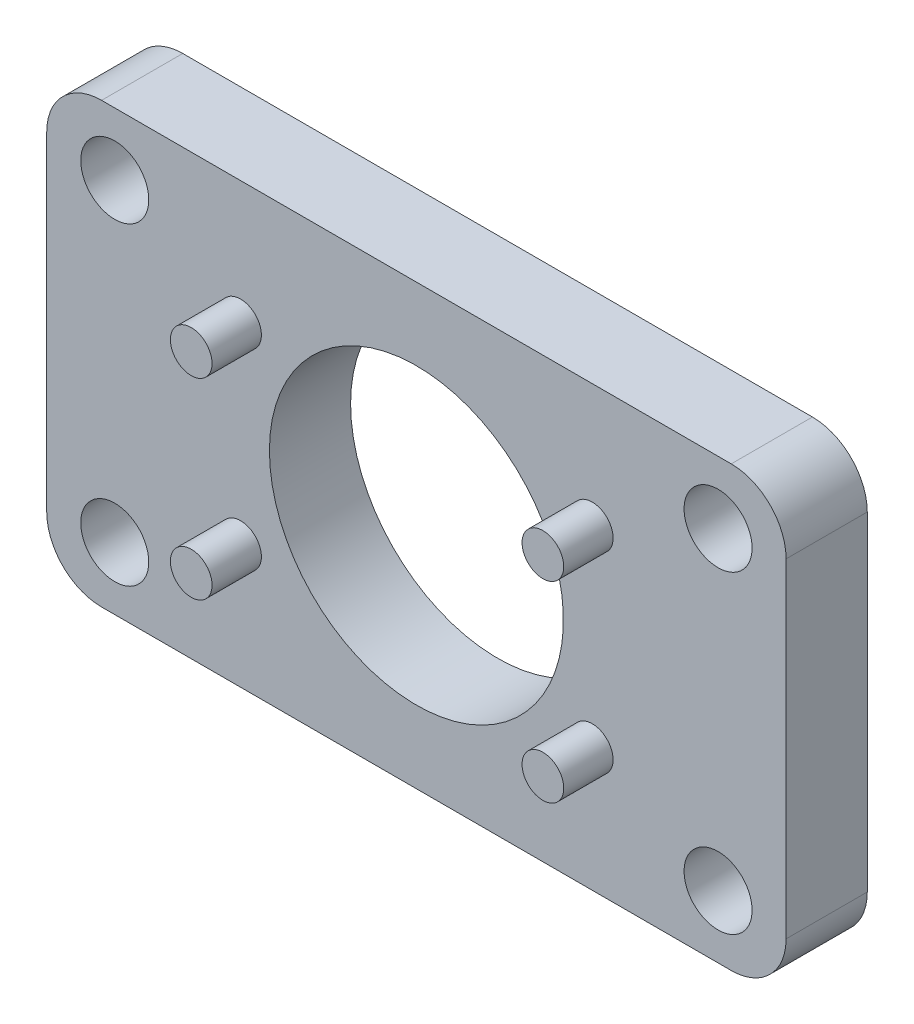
ISO-10303-21;
HEADER;
FILE_DESCRIPTION(('STEP AP214'),'2;1');
FILE_NAME('part.step','',(''),(''),'','','');
FILE_SCHEMA(('AUTOMOTIVE_DESIGN { 1 0 10303 214 1 1 1 1 }'));
ENDSEC;
DATA;
#1=APPLICATION_CONTEXT('core data for automotive mechanical design processes');
#2=APPLICATION_PROTOCOL_DEFINITION('international standard','automotive_design',2000,#1);
#3=PRODUCT_CONTEXT('',#1,'mechanical');
#4=PRODUCT('Part','Part','',(#3));
#5=PRODUCT_RELATED_PRODUCT_CATEGORY('part','',(#4));
#6=PRODUCT_DEFINITION_FORMATION('','',#4);
#7=PRODUCT_DEFINITION_CONTEXT('part definition',#1,'design');
#8=PRODUCT_DEFINITION('design','',#6,#7);
#9=PRODUCT_DEFINITION_SHAPE('','',#8);
#10=(LENGTH_UNIT() NAMED_UNIT(*) SI_UNIT(.MILLI.,.METRE.));
#11=(NAMED_UNIT(*) PLANE_ANGLE_UNIT() SI_UNIT($,.RADIAN.));
#12=(NAMED_UNIT(*) SI_UNIT($,.STERADIAN.) SOLID_ANGLE_UNIT());
#13=UNCERTAINTY_MEASURE_WITH_UNIT(LENGTH_MEASURE(1.E-05),#10,'distance_accuracy_value','');
#14=(GEOMETRIC_REPRESENTATION_CONTEXT(3) GLOBAL_UNCERTAINTY_ASSIGNED_CONTEXT((#13)) GLOBAL_UNIT_ASSIGNED_CONTEXT((#10,
#11,#12)) REPRESENTATION_CONTEXT('',''));
#15=CARTESIAN_POINT('',(0.,0.,0.));
#16=DIRECTION('',(0.,0.,1.));
#17=DIRECTION('',(1.,0.,0.));
#18=AXIS2_PLACEMENT_3D('',#15,#16,#17);
#19=CARTESIAN_POINT('',(-22.3431082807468,-14.5506351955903,-6.34999779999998));
#20=DIRECTION('',(0.,0.,1.));
#21=DIRECTION('',(0.,-1.,0.));
#22=AXIS2_PLACEMENT_3D('',#19,#20,#21);
#23=PLANE('',#22);
#24=DIRECTION('',(1.0206808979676E-11,1.,0.));
#25=VECTOR('',#24,1.);
#26=CARTESIAN_POINT('',(-22.3431082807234,-12.2585450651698,-6.34999779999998));
#27=LINE('',#26,#25);
#28=CARTESIAN_POINT('',(-22.3431082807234,-12.2585450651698,-6.34999779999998));
#29=VERTEX_POINT('',#28);
#30=CARTESIAN_POINT('',(-22.3431082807,-9.96645493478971,-6.34999779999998));
#31=VERTEX_POINT('',#30);
#32=EDGE_CURVE('E695',#29,#31,#27,.T.);
#33=ORIENTED_EDGE('',*,*,#32,.T.);
#34=DIRECTION('',(0.86602540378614,0.499999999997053,0.));
#35=VECTOR('',#34,1.);
#36=CARTESIAN_POINT('',(-22.3431082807,-9.96645493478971,-6.34999779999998));
#37=LINE('',#36,#35);
#38=CARTESIAN_POINT('',(-20.3580999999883,-8.82040986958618,-6.34999779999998));
#39=VERTEX_POINT('',#38);
#40=EDGE_CURVE('E722',#31,#39,#37,.T.);
#41=ORIENTED_EDGE('',*,*,#40,.T.);
#42=DIRECTION('',(0.866025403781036,-0.500000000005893,0.));
#43=VECTOR('',#42,1.);
#44=CARTESIAN_POINT('',(-20.3580999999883,-8.82040986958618,-6.34999779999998));
#45=LINE('',#44,#43);
#46=CARTESIAN_POINT('',(-18.3730917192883,-9.96645493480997,-6.34999779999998));
#47=VERTEX_POINT('',#46);
#48=EDGE_CURVE('E719',#39,#47,#45,.T.);
#49=ORIENTED_EDGE('',*,*,#48,.T.);
#50=DIRECTION('',(-1.0206998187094E-11,-1.,0.));
#51=VECTOR('',#50,1.);
#52=CARTESIAN_POINT('',(-18.3730917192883,-9.96645493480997,-6.34999779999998));
#53=LINE('',#52,#51);
#54=CARTESIAN_POINT('',(-18.3730917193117,-12.2585450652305,-6.34999779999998));
#55=VERTEX_POINT('',#54);
#56=EDGE_CURVE('E716',#47,#55,#53,.T.);
#57=ORIENTED_EDGE('',*,*,#56,.T.);
#58=DIRECTION('',(-0.866025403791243,-0.499999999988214,0.));
#59=VECTOR('',#58,1.);
#60=CARTESIAN_POINT('',(-18.3730917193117,-12.2585450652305,-6.34999779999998));
#61=LINE('',#60,#59);
#62=CARTESIAN_POINT('',(-20.3581000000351,-13.4045901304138,-6.34999779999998));
#63=VERTEX_POINT('',#62);
#64=EDGE_CURVE('E713',#55,#63,#61,.T.);
#65=ORIENTED_EDGE('',*,*,#64,.T.);
#66=DIRECTION('',(-0.866025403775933,0.500000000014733,0.));
#67=VECTOR('',#66,1.);
#68=CARTESIAN_POINT('',(-20.3581000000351,-13.4045901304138,-6.34999779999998));
#69=LINE('',#68,#67);
#70=EDGE_CURVE('E683',#63,#29,#69,.T.);
#71=ORIENTED_EDGE('',*,*,#70,.T.);
#72=EDGE_LOOP('',(#33,#41,#49,#57,#65,#71));
#73=FACE_BOUND('',#72,.T.);
#74=ADVANCED_FACE('F15',(#73),#23,.F.);
#75=CARTESIAN_POINT('',(-18.3730917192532,14.5506351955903,-6.34999779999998));
#76=DIRECTION('',(0.,0.,1.));
#77=DIRECTION('',(0.,1.,0.));
#78=AXIS2_PLACEMENT_3D('',#75,#76,#77);
#79=PLANE('',#78);
#80=DIRECTION('',(-1.02068367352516E-11,-1.,0.));
#81=VECTOR('',#80,1.);
#82=CARTESIAN_POINT('',(-18.3730917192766,12.2585450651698,-6.34999779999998));
#83=LINE('',#82,#81);
#84=CARTESIAN_POINT('',(-18.3730917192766,12.2585450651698,-6.34999779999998));
#85=VERTEX_POINT('',#84);
#86=CARTESIAN_POINT('',(-18.3730917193,9.96645493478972,-6.34999779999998));
#87=VERTEX_POINT('',#86);
#88=EDGE_CURVE('E759',#85,#87,#83,.T.);
#89=ORIENTED_EDGE('',*,*,#88,.T.);
#90=DIRECTION('',(-0.86602540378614,-0.499999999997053,0.));
#91=VECTOR('',#90,1.);
#92=CARTESIAN_POINT('',(-18.3730917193,9.96645493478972,-6.34999779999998));
#93=LINE('',#92,#91);
#94=CARTESIAN_POINT('',(-20.3581000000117,8.82040986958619,-6.34999779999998));
#95=VERTEX_POINT('',#94);
#96=EDGE_CURVE('E785',#87,#95,#93,.T.);
#97=ORIENTED_EDGE('',*,*,#96,.T.);
#98=DIRECTION('',(-0.866025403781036,0.500000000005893,0.));
#99=VECTOR('',#98,1.);
#100=CARTESIAN_POINT('',(-20.3581000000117,8.82040986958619,-6.34999779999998));
#101=LINE('',#100,#99);
#102=CARTESIAN_POINT('',(-22.3431082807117,9.96645493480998,-6.34999779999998));
#103=VERTEX_POINT('',#102);
#104=EDGE_CURVE('E782',#95,#103,#101,.T.);
#105=ORIENTED_EDGE('',*,*,#104,.T.);
#106=DIRECTION('',(1.02070259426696E-11,1.,0.));
#107=VECTOR('',#106,1.);
#108=CARTESIAN_POINT('',(-22.3431082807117,9.96645493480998,-6.34999779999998));
#109=LINE('',#108,#107);
#110=CARTESIAN_POINT('',(-22.3431082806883,12.2585450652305,-6.34999779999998));
#111=VERTEX_POINT('',#110);
#112=EDGE_CURVE('E779',#103,#111,#109,.T.);
#113=ORIENTED_EDGE('',*,*,#112,.T.);
#114=DIRECTION('',(0.866025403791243,0.499999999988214,0.));
#115=VECTOR('',#114,1.);
#116=CARTESIAN_POINT('',(-22.3431082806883,12.2585450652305,-6.34999779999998));
#117=LINE('',#116,#115);
#118=CARTESIAN_POINT('',(-20.3580999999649,13.4045901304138,-6.34999779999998));
#119=VERTEX_POINT('',#118);
#120=EDGE_CURVE('E776',#111,#119,#117,.T.);
#121=ORIENTED_EDGE('',*,*,#120,.T.);
#122=DIRECTION('',(0.866025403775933,-0.500000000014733,0.));
#123=VECTOR('',#122,1.);
#124=CARTESIAN_POINT('',(-20.3580999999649,13.4045901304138,-6.34999779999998));
#125=LINE('',#124,#123);
#126=EDGE_CURVE('E747',#119,#85,#125,.T.);
#127=ORIENTED_EDGE('',*,*,#126,.T.);
#128=EDGE_LOOP('',(#89,#97,#105,#113,#121,#127));
#129=FACE_BOUND('',#128,.T.);
#130=ADVANCED_FACE('F438',(#129),#79,.F.);
#131=CARTESIAN_POINT('',(18.3730917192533,7.6743648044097,-6.34999780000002));
#132=DIRECTION('',(0.,0.,1.));
#133=DIRECTION('',(0.,-1.,0.));
#134=AXIS2_PLACEMENT_3D('',#131,#132,#133);
#135=PLANE('',#134);
#136=DIRECTION('',(1.02064308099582E-11,1.,0.));
#137=VECTOR('',#136,1.);
#138=CARTESIAN_POINT('',(18.3730917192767,9.96645493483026,-6.34999780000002));
#139=LINE('',#138,#137);
#140=CARTESIAN_POINT('',(18.3730917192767,9.96645493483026,-6.34999780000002));
#141=VERTEX_POINT('',#140);
#142=CARTESIAN_POINT('',(18.3730917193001,12.2585450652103,-6.34999780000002));
#143=VERTEX_POINT('',#142);
#144=EDGE_CURVE('E205',#141,#143,#139,.T.);
#145=ORIENTED_EDGE('',*,*,#144,.T.);
#146=DIRECTION('',(0.86602540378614,0.499999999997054,0.));
#147=VECTOR('',#146,1.);
#148=CARTESIAN_POINT('',(18.3730917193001,12.2585450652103,-6.34999780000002));
#149=LINE('',#148,#147);
#150=CARTESIAN_POINT('',(20.3581000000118,13.4045901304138,-6.34999780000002));
#151=VERTEX_POINT('',#150);
#152=EDGE_CURVE('E368',#143,#151,#149,.T.);
#153=ORIENTED_EDGE('',*,*,#152,.T.);
#154=DIRECTION('',(0.866025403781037,-0.500000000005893,0.));
#155=VECTOR('',#154,1.);
#156=CARTESIAN_POINT('',(20.3581000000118,13.4045901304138,-6.34999780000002));
#157=LINE('',#156,#155);
#158=CARTESIAN_POINT('',(22.3431082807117,12.25854506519,-6.34999780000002));
#159=VERTEX_POINT('',#158);
#160=EDGE_CURVE('E371',#151,#159,#157,.T.);
#161=ORIENTED_EDGE('',*,*,#160,.T.);
#162=DIRECTION('',(-1.02066200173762E-11,-1.,0.));
#163=VECTOR('',#162,1.);
#164=CARTESIAN_POINT('',(22.3431082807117,12.25854506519,-6.34999780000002));
#165=LINE('',#164,#163);
#166=CARTESIAN_POINT('',(22.3431082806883,9.96645493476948,-6.34999780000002));
#167=VERTEX_POINT('',#166);
#168=EDGE_CURVE('E374',#159,#167,#165,.T.);
#169=ORIENTED_EDGE('',*,*,#168,.T.);
#170=DIRECTION('',(-0.866025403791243,-0.499999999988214,0.));
#171=VECTOR('',#170,1.);
#172=CARTESIAN_POINT('',(22.3431082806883,9.96645493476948,-6.34999780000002));
#173=LINE('',#172,#171);
#174=CARTESIAN_POINT('',(20.3580999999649,8.82040986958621,-6.34999780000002));
#175=VERTEX_POINT('',#174);
#176=EDGE_CURVE('E376',#167,#175,#173,.T.);
#177=ORIENTED_EDGE('',*,*,#176,.T.);
#178=DIRECTION('',(-0.866025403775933,0.500000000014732,0.));
#179=VECTOR('',#178,1.);
#180=CARTESIAN_POINT('',(20.3580999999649,8.82040986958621,-6.34999780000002));
#181=LINE('',#180,#179);
#182=EDGE_CURVE('E233',#175,#141,#181,.T.);
#183=ORIENTED_EDGE('',*,*,#182,.T.);
#184=EDGE_LOOP('',(#145,#153,#161,#169,#177,#183));
#185=FACE_BOUND('',#184,.T.);
#186=ADVANCED_FACE('F380',(#185),#135,.F.);
#187=CARTESIAN_POINT('',(-22.3431082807,-9.96645493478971,-6.34999779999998));
#188=DIRECTION('',(-0.499999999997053,0.86602540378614,0.));
#189=DIRECTION('',(0.86602540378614,0.499999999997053,0.));
#190=AXIS2_PLACEMENT_3D('',#187,#188,#189);
#191=PLANE('',#190);
#192=DIRECTION('',(0.86602540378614,0.499999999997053,0.));
#193=VECTOR('',#192,1.);
#194=CARTESIAN_POINT('',(-22.3431082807,-9.96645493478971,-8.63599581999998));
#195=LINE('',#194,#193);
#196=CARTESIAN_POINT('',(-22.3431082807,-9.96645493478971,-8.63599581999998));
#197=VERTEX_POINT('',#196);
#198=CARTESIAN_POINT('',(-20.3580999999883,-8.82040986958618,-8.63599581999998));
#199=VERTEX_POINT('',#198);
#200=EDGE_CURVE('E705',#197,#199,#195,.T.);
#201=ORIENTED_EDGE('',*,*,#200,.T.);
#202=DIRECTION('',(0.,0.,-1.));
#203=VECTOR('',#202,1.);
#204=CARTESIAN_POINT('',(-20.3580999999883,-8.82040986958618,-6.34999779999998));
#205=LINE('',#204,#203);
#206=EDGE_CURVE('E682',#39,#199,#205,.T.);
#207=ORIENTED_EDGE('',*,*,#206,.F.);
#208=ORIENTED_EDGE('',*,*,#40,.F.);
#209=DIRECTION('',(0.,0.,-1.));
#210=VECTOR('',#209,1.);
#211=CARTESIAN_POINT('',(-22.3431082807,-9.96645493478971,-6.34999779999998));
#212=LINE('',#211,#210);
#213=EDGE_CURVE('E679',#31,#197,#212,.T.);
#214=ORIENTED_EDGE('',*,*,#213,.T.);
#215=EDGE_LOOP('',(#201,#207,#208,#214));
#216=FACE_BOUND('',#215,.T.);
#217=ADVANCED_FACE('F497',(#216),#191,.F.);
#218=CARTESIAN_POINT('',(-20.3580999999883,-8.82040986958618,-6.34999779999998));
#219=DIRECTION('',(0.500000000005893,0.866025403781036,0.));
#220=DIRECTION('',(0.866025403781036,-0.500000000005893,0.));
#221=AXIS2_PLACEMENT_3D('',#218,#219,#220);
#222=PLANE('',#221);
#223=DIRECTION('',(0.866025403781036,-0.500000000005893,0.));
#224=VECTOR('',#223,1.);
#225=CARTESIAN_POINT('',(-20.3580999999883,-8.82040986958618,-8.63599581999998));
#226=LINE('',#225,#224);
#227=CARTESIAN_POINT('',(-18.3730917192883,-9.96645493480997,-8.63599581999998));
#228=VERTEX_POINT('',#227);
#229=EDGE_CURVE('E702',#199,#228,#226,.T.);
#230=ORIENTED_EDGE('',*,*,#229,.T.);
#231=DIRECTION('',(0.,0.,-1.));
#232=VECTOR('',#231,1.);
#233=CARTESIAN_POINT('',(-18.3730917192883,-9.96645493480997,-6.34999779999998));
#234=LINE('',#233,#232);
#235=EDGE_CURVE('E685',#47,#228,#234,.T.);
#236=ORIENTED_EDGE('',*,*,#235,.F.);
#237=ORIENTED_EDGE('',*,*,#48,.F.);
#238=ORIENTED_EDGE('',*,*,#206,.T.);
#239=EDGE_LOOP('',(#230,#236,#237,#238));
#240=FACE_BOUND('',#239,.T.);
#241=ADVANCED_FACE('F509',(#240),#222,.F.);
#242=CARTESIAN_POINT('',(-18.3730917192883,-9.96645493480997,-6.34999779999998));
#243=DIRECTION('',(1.,-1.0206998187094E-11,0.));
#244=DIRECTION('',(-1.0206998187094E-11,-1.,0.));
#245=AXIS2_PLACEMENT_3D('',#242,#243,#244);
#246=PLANE('',#245);
#247=DIRECTION('',(-1.0206998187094E-11,-1.,0.));
#248=VECTOR('',#247,1.);
#249=CARTESIAN_POINT('',(-18.3730917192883,-9.96645493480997,-8.63599581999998));
#250=LINE('',#249,#248);
#251=CARTESIAN_POINT('',(-18.3730917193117,-12.2585450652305,-8.63599581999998));
#252=VERTEX_POINT('',#251);
#253=EDGE_CURVE('E699',#228,#252,#250,.T.);
#254=ORIENTED_EDGE('',*,*,#253,.T.);
#255=DIRECTION('',(0.,0.,-1.));
#256=VECTOR('',#255,1.);
#257=CARTESIAN_POINT('',(-18.3730917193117,-12.2585450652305,-6.34999779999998));
#258=LINE('',#257,#256);
#259=EDGE_CURVE('E687',#55,#252,#258,.T.);
#260=ORIENTED_EDGE('',*,*,#259,.F.);
#261=ORIENTED_EDGE('',*,*,#56,.F.);
#262=ORIENTED_EDGE('',*,*,#235,.T.);
#263=EDGE_LOOP('',(#254,#260,#261,#262));
#264=FACE_BOUND('',#263,.T.);
#265=ADVANCED_FACE('F505',(#264),#246,.F.);
#266=CARTESIAN_POINT('',(-18.3730917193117,-12.2585450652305,-6.34999779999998));
#267=DIRECTION('',(0.499999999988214,-0.866025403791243,0.));
#268=DIRECTION('',(-0.866025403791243,-0.499999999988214,0.));
#269=AXIS2_PLACEMENT_3D('',#266,#267,#268);
#270=PLANE('',#269);
#271=DIRECTION('',(-0.866025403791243,-0.499999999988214,0.));
#272=VECTOR('',#271,1.);
#273=CARTESIAN_POINT('',(-18.3730917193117,-12.2585450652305,-8.63599581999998));
#274=LINE('',#273,#272);
#275=CARTESIAN_POINT('',(-20.3581000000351,-13.4045901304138,-8.63599581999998));
#276=VERTEX_POINT('',#275);
#277=EDGE_CURVE('E696',#252,#276,#274,.T.);
#278=ORIENTED_EDGE('',*,*,#277,.T.);
#279=DIRECTION('',(0.,0.,-1.));
#280=VECTOR('',#279,1.);
#281=CARTESIAN_POINT('',(-20.3581000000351,-13.4045901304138,-6.34999779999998));
#282=LINE('',#281,#280);
#283=EDGE_CURVE('E689',#63,#276,#282,.T.);
#284=ORIENTED_EDGE('',*,*,#283,.F.);
#285=ORIENTED_EDGE('',*,*,#64,.F.);
#286=ORIENTED_EDGE('',*,*,#259,.T.);
#287=EDGE_LOOP('',(#278,#284,#285,#286));
#288=FACE_BOUND('',#287,.T.);
#289=ADVANCED_FACE('F501',(#288),#270,.F.);
#290=CARTESIAN_POINT('',(-20.3581000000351,-13.4045901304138,-6.34999779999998));
#291=DIRECTION('',(-0.500000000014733,-0.866025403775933,0.));
#292=DIRECTION('',(-0.866025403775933,0.500000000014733,0.));
#293=AXIS2_PLACEMENT_3D('',#290,#291,#292);
#294=PLANE('',#293);
#295=DIRECTION('',(-0.866025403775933,0.500000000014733,0.));
#296=VECTOR('',#295,1.);
#297=CARTESIAN_POINT('',(-20.3581000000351,-13.4045901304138,-8.63599581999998));
#298=LINE('',#297,#296);
#299=CARTESIAN_POINT('',(-22.3431082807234,-12.2585450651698,-8.63599581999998));
#300=VERTEX_POINT('',#299);
#301=EDGE_CURVE('E692',#276,#300,#298,.T.);
#302=ORIENTED_EDGE('',*,*,#301,.T.);
#303=DIRECTION('',(0.,0.,-1.));
#304=VECTOR('',#303,1.);
#305=CARTESIAN_POINT('',(-22.3431082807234,-12.2585450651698,-6.34999779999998));
#306=LINE('',#305,#304);
#307=EDGE_CURVE('E678',#29,#300,#306,.T.);
#308=ORIENTED_EDGE('',*,*,#307,.F.);
#309=ORIENTED_EDGE('',*,*,#70,.F.);
#310=ORIENTED_EDGE('',*,*,#283,.T.);
#311=EDGE_LOOP('',(#302,#308,#309,#310));
#312=FACE_BOUND('',#311,.T.);
#313=ADVANCED_FACE('F498',(#312),#294,.F.);
#314=CARTESIAN_POINT('',(-22.3431082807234,-12.2585450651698,-6.34999779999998));
#315=DIRECTION('',(-1.,1.0206808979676E-11,0.));
#316=DIRECTION('',(1.0206808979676E-11,1.,0.));
#317=AXIS2_PLACEMENT_3D('',#314,#315,#316);
#318=PLANE('',#317);
#319=DIRECTION('',(1.0206808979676E-11,1.,0.));
#320=VECTOR('',#319,1.);
#321=CARTESIAN_POINT('',(-22.3431082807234,-12.2585450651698,-8.63599581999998));
#322=LINE('',#321,#320);
#323=EDGE_CURVE('E708',#300,#197,#322,.T.);
#324=ORIENTED_EDGE('',*,*,#323,.T.);
#325=ORIENTED_EDGE('',*,*,#213,.F.);
#326=ORIENTED_EDGE('',*,*,#32,.F.);
#327=ORIENTED_EDGE('',*,*,#307,.T.);
#328=EDGE_LOOP('',(#324,#325,#326,#327));
#329=FACE_BOUND('',#328,.T.);
#330=ADVANCED_FACE('F462',(#329),#318,.F.);
#331=CARTESIAN_POINT('',(-18.3730917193,9.96645493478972,-6.34999779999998));
#332=DIRECTION('',(0.499999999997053,-0.86602540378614,0.));
#333=DIRECTION('',(-0.86602540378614,-0.499999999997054,0.));
#334=AXIS2_PLACEMENT_3D('',#331,#332,#333);
#335=PLANE('',#334);
#336=DIRECTION('',(-0.86602540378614,-0.499999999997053,0.));
#337=VECTOR('',#336,1.);
#338=CARTESIAN_POINT('',(-18.3730917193,9.96645493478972,-8.63599581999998));
#339=LINE('',#338,#337);
#340=CARTESIAN_POINT('',(-18.3730917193,9.96645493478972,-8.63599581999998));
#341=VERTEX_POINT('',#340);
#342=CARTESIAN_POINT('',(-20.3581000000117,8.82040986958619,-8.63599581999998));
#343=VERTEX_POINT('',#342);
#344=EDGE_CURVE('E769',#341,#343,#339,.T.);
#345=ORIENTED_EDGE('',*,*,#344,.T.);
#346=DIRECTION('',(0.,0.,-1.));
#347=VECTOR('',#346,1.);
#348=CARTESIAN_POINT('',(-20.3581000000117,8.82040986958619,-6.34999779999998));
#349=LINE('',#348,#347);
#350=EDGE_CURVE('E746',#95,#343,#349,.T.);
#351=ORIENTED_EDGE('',*,*,#350,.F.);
#352=ORIENTED_EDGE('',*,*,#96,.F.);
#353=DIRECTION('',(0.,0.,-1.));
#354=VECTOR('',#353,1.);
#355=CARTESIAN_POINT('',(-18.3730917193,9.96645493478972,-6.34999779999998));
#356=LINE('',#355,#354);
#357=EDGE_CURVE('E743',#87,#341,#356,.T.);
#358=ORIENTED_EDGE('',*,*,#357,.T.);
#359=EDGE_LOOP('',(#345,#351,#352,#358));
#360=FACE_BOUND('',#359,.T.);
#361=ADVANCED_FACE('F442',(#360),#335,.F.);
#362=CARTESIAN_POINT('',(-20.3581000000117,8.82040986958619,-6.34999779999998));
#363=DIRECTION('',(-0.500000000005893,-0.866025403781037,0.));
#364=DIRECTION('',(-0.866025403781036,0.500000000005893,0.));
#365=AXIS2_PLACEMENT_3D('',#362,#363,#364);
#366=PLANE('',#365);
#367=DIRECTION('',(-0.866025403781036,0.500000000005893,0.));
#368=VECTOR('',#367,1.);
#369=CARTESIAN_POINT('',(-20.3581000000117,8.82040986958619,-8.63599581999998));
#370=LINE('',#369,#368);
#371=CARTESIAN_POINT('',(-22.3431082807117,9.96645493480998,-8.63599581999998));
#372=VERTEX_POINT('',#371);
#373=EDGE_CURVE('E766',#343,#372,#370,.T.);
#374=ORIENTED_EDGE('',*,*,#373,.T.);
#375=DIRECTION('',(0.,0.,-1.));
#376=VECTOR('',#375,1.);
#377=CARTESIAN_POINT('',(-22.3431082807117,9.96645493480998,-6.34999779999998));
#378=LINE('',#377,#376);
#379=EDGE_CURVE('E749',#103,#372,#378,.T.);
#380=ORIENTED_EDGE('',*,*,#379,.F.);
#381=ORIENTED_EDGE('',*,*,#104,.F.);
#382=ORIENTED_EDGE('',*,*,#350,.T.);
#383=EDGE_LOOP('',(#374,#380,#381,#382));
#384=FACE_BOUND('',#383,.T.);
#385=ADVANCED_FACE('F455',(#384),#366,.F.);
#386=CARTESIAN_POINT('',(-22.3431082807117,9.96645493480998,-6.34999779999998));
#387=DIRECTION('',(-1.,1.02070259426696E-11,0.));
#388=DIRECTION('',(1.02070259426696E-11,1.,0.));
#389=AXIS2_PLACEMENT_3D('',#386,#387,#388);
#390=PLANE('',#389);
#391=DIRECTION('',(1.02070259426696E-11,1.,0.));
#392=VECTOR('',#391,1.);
#393=CARTESIAN_POINT('',(-22.3431082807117,9.96645493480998,-8.63599581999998));
#394=LINE('',#393,#392);
#395=CARTESIAN_POINT('',(-22.3431082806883,12.2585450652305,-8.63599581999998));
#396=VERTEX_POINT('',#395);
#397=EDGE_CURVE('E763',#372,#396,#394,.T.);
#398=ORIENTED_EDGE('',*,*,#397,.T.);
#399=DIRECTION('',(0.,0.,-1.));
#400=VECTOR('',#399,1.);
#401=CARTESIAN_POINT('',(-22.3431082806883,12.2585450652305,-6.34999779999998));
#402=LINE('',#401,#400);
#403=EDGE_CURVE('E751',#111,#396,#402,.T.);
#404=ORIENTED_EDGE('',*,*,#403,.F.);
#405=ORIENTED_EDGE('',*,*,#112,.F.);
#406=ORIENTED_EDGE('',*,*,#379,.T.);
#407=EDGE_LOOP('',(#398,#404,#405,#406));
#408=FACE_BOUND('',#407,.T.);
#409=ADVANCED_FACE('F451',(#408),#390,.F.);
#410=CARTESIAN_POINT('',(-22.3431082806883,12.2585450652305,-6.34999779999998));
#411=DIRECTION('',(-0.499999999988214,0.866025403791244,0.));
#412=DIRECTION('',(0.866025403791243,0.499999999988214,0.));
#413=AXIS2_PLACEMENT_3D('',#410,#411,#412);
#414=PLANE('',#413);
#415=DIRECTION('',(0.866025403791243,0.499999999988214,0.));
#416=VECTOR('',#415,1.);
#417=CARTESIAN_POINT('',(-22.3431082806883,12.2585450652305,-8.63599581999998));
#418=LINE('',#417,#416);
#419=CARTESIAN_POINT('',(-20.3580999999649,13.4045901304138,-8.63599581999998));
#420=VERTEX_POINT('',#419);
#421=EDGE_CURVE('E760',#396,#420,#418,.T.);
#422=ORIENTED_EDGE('',*,*,#421,.T.);
#423=DIRECTION('',(0.,0.,-1.));
#424=VECTOR('',#423,1.);
#425=CARTESIAN_POINT('',(-20.3580999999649,13.4045901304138,-6.34999779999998));
#426=LINE('',#425,#424);
#427=EDGE_CURVE('E753',#119,#420,#426,.T.);
#428=ORIENTED_EDGE('',*,*,#427,.F.);
#429=ORIENTED_EDGE('',*,*,#120,.F.);
#430=ORIENTED_EDGE('',*,*,#403,.T.);
#431=EDGE_LOOP('',(#422,#428,#429,#430));
#432=FACE_BOUND('',#431,.T.);
#433=ADVANCED_FACE('F447',(#432),#414,.F.);
#434=CARTESIAN_POINT('',(-20.3580999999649,13.4045901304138,-6.34999779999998));
#435=DIRECTION('',(0.500000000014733,0.866025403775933,0.));
#436=DIRECTION('',(0.866025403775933,-0.500000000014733,0.));
#437=AXIS2_PLACEMENT_3D('',#434,#435,#436);
#438=PLANE('',#437);
#439=DIRECTION('',(0.866025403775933,-0.500000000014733,0.));
#440=VECTOR('',#439,1.);
#441=CARTESIAN_POINT('',(-20.3580999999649,13.4045901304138,-8.63599581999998));
#442=LINE('',#441,#440);
#443=CARTESIAN_POINT('',(-18.3730917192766,12.2585450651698,-8.63599581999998));
#444=VERTEX_POINT('',#443);
#445=EDGE_CURVE('E756',#420,#444,#442,.T.);
#446=ORIENTED_EDGE('',*,*,#445,.T.);
#447=DIRECTION('',(0.,0.,-1.));
#448=VECTOR('',#447,1.);
#449=CARTESIAN_POINT('',(-18.3730917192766,12.2585450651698,-6.34999779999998));
#450=LINE('',#449,#448);
#451=EDGE_CURVE('E742',#85,#444,#450,.T.);
#452=ORIENTED_EDGE('',*,*,#451,.F.);
#453=ORIENTED_EDGE('',*,*,#126,.F.);
#454=ORIENTED_EDGE('',*,*,#427,.T.);
#455=EDGE_LOOP('',(#446,#452,#453,#454));
#456=FACE_BOUND('',#455,.T.);
#457=ADVANCED_FACE('F443',(#456),#438,.F.);
#458=CARTESIAN_POINT('',(-18.3730917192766,12.2585450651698,-6.34999779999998));
#459=DIRECTION('',(1.,-1.02068367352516E-11,0.));
#460=DIRECTION('',(-1.02068367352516E-11,-1.,0.));
#461=AXIS2_PLACEMENT_3D('',#458,#459,#460);
#462=PLANE('',#461);
#463=DIRECTION('',(-1.02068367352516E-11,-1.,0.));
#464=VECTOR('',#463,1.);
#465=CARTESIAN_POINT('',(-18.3730917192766,12.2585450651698,-8.63599581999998));
#466=LINE('',#465,#464);
#467=EDGE_CURVE('E772',#444,#341,#466,.T.);
#468=ORIENTED_EDGE('',*,*,#467,.T.);
#469=ORIENTED_EDGE('',*,*,#357,.F.);
#470=ORIENTED_EDGE('',*,*,#88,.F.);
#471=ORIENTED_EDGE('',*,*,#451,.T.);
#472=EDGE_LOOP('',(#468,#469,#470,#471));
#473=FACE_BOUND('',#472,.T.);
#474=ADVANCED_FACE('F446',(#473),#462,.F.);
#475=CARTESIAN_POINT('',(18.3730917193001,12.2585450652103,-6.34999780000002));
#476=DIRECTION('',(-0.499999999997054,0.86602540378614,0.));
#477=DIRECTION('',(0.86602540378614,0.499999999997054,0.));
#478=AXIS2_PLACEMENT_3D('',#475,#476,#477);
#479=PLANE('',#478);
#480=DIRECTION('',(0.86602540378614,0.499999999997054,0.));
#481=VECTOR('',#480,1.);
#482=CARTESIAN_POINT('',(18.3730917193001,12.2585450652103,-8.63599582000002));
#483=LINE('',#482,#481);
#484=CARTESIAN_POINT('',(18.3730917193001,12.2585450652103,-8.63599582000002));
#485=VERTEX_POINT('',#484);
#486=CARTESIAN_POINT('',(20.3581000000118,13.4045901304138,-8.63599582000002));
#487=VERTEX_POINT('',#486);
#488=EDGE_CURVE('E225',#485,#487,#483,.T.);
#489=ORIENTED_EDGE('',*,*,#488,.T.);
#490=DIRECTION('',(0.,0.,-1.));
#491=VECTOR('',#490,1.);
#492=CARTESIAN_POINT('',(20.3581000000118,13.4045901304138,-6.34999780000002));
#493=LINE('',#492,#491);
#494=EDGE_CURVE('E247',#151,#487,#493,.T.);
#495=ORIENTED_EDGE('',*,*,#494,.F.);
#496=ORIENTED_EDGE('',*,*,#152,.F.);
#497=DIRECTION('',(0.,0.,-1.));
#498=VECTOR('',#497,1.);
#499=CARTESIAN_POINT('',(18.3730917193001,12.2585450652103,-6.34999780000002));
#500=LINE('',#499,#498);
#501=EDGE_CURVE('E249',#143,#485,#500,.T.);
#502=ORIENTED_EDGE('',*,*,#501,.T.);
#503=EDGE_LOOP('',(#489,#495,#496,#502));
#504=FACE_BOUND('',#503,.T.);
#505=ADVANCED_FACE('F384',(#504),#479,.F.);
#506=CARTESIAN_POINT('',(20.3581000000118,13.4045901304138,-6.34999780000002));
#507=DIRECTION('',(0.500000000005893,0.866025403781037,0.));
#508=DIRECTION('',(0.866025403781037,-0.500000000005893,0.));
#509=AXIS2_PLACEMENT_3D('',#506,#507,#508);
#510=PLANE('',#509);
#511=DIRECTION('',(0.866025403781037,-0.500000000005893,0.));
#512=VECTOR('',#511,1.);
#513=CARTESIAN_POINT('',(20.3581000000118,13.4045901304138,-8.63599582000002));
#514=LINE('',#513,#512);
#515=CARTESIAN_POINT('',(22.3431082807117,12.25854506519,-8.63599582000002));
#516=VERTEX_POINT('',#515);
#517=EDGE_CURVE('E228',#487,#516,#514,.T.);
#518=ORIENTED_EDGE('',*,*,#517,.T.);
#519=DIRECTION('',(0.,0.,-1.));
#520=VECTOR('',#519,1.);
#521=CARTESIAN_POINT('',(22.3431082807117,12.25854506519,-6.34999780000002));
#522=LINE('',#521,#520);
#523=EDGE_CURVE('E245',#159,#516,#522,.T.);
#524=ORIENTED_EDGE('',*,*,#523,.F.);
#525=ORIENTED_EDGE('',*,*,#160,.F.);
#526=ORIENTED_EDGE('',*,*,#494,.T.);
#527=EDGE_LOOP('',(#518,#524,#525,#526));
#528=FACE_BOUND('',#527,.T.);
#529=ADVANCED_FACE('F386',(#528),#510,.F.);
#530=CARTESIAN_POINT('',(22.3431082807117,12.25854506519,-6.34999780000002));
#531=DIRECTION('',(1.,-1.02066200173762E-11,0.));
#532=DIRECTION('',(-1.02066200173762E-11,-1.,0.));
#533=AXIS2_PLACEMENT_3D('',#530,#531,#532);
#534=PLANE('',#533);
#535=DIRECTION('',(-1.02066200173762E-11,-1.,0.));
#536=VECTOR('',#535,1.);
#537=CARTESIAN_POINT('',(22.3431082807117,12.25854506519,-8.63599582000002));
#538=LINE('',#537,#536);
#539=CARTESIAN_POINT('',(22.3431082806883,9.96645493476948,-8.63599582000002));
#540=VERTEX_POINT('',#539);
#541=EDGE_CURVE('E238',#516,#540,#538,.T.);
#542=ORIENTED_EDGE('',*,*,#541,.T.);
#543=DIRECTION('',(0.,0.,-1.));
#544=VECTOR('',#543,1.);
#545=CARTESIAN_POINT('',(22.3431082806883,9.96645493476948,-6.34999780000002));
#546=LINE('',#545,#544);
#547=EDGE_CURVE('E243',#167,#540,#546,.T.);
#548=ORIENTED_EDGE('',*,*,#547,.F.);
#549=ORIENTED_EDGE('',*,*,#168,.F.);
#550=ORIENTED_EDGE('',*,*,#523,.T.);
#551=EDGE_LOOP('',(#542,#548,#549,#550));
#552=FACE_BOUND('',#551,.T.);
#553=ADVANCED_FACE('F390',(#552),#534,.F.);
#554=CARTESIAN_POINT('',(22.3431082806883,9.96645493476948,-6.34999780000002));
#555=DIRECTION('',(0.499999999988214,-0.866025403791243,0.));
#556=DIRECTION('',(-0.866025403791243,-0.499999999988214,0.));
#557=AXIS2_PLACEMENT_3D('',#554,#555,#556);
#558=PLANE('',#557);
#559=DIRECTION('',(-0.866025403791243,-0.499999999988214,0.));
#560=VECTOR('',#559,1.);
#561=CARTESIAN_POINT('',(22.3431082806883,9.96645493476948,-8.63599582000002));
#562=LINE('',#561,#560);
#563=CARTESIAN_POINT('',(20.3580999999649,8.82040986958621,-8.63599582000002));
#564=VERTEX_POINT('',#563);
#565=EDGE_CURVE('E218',#540,#564,#562,.T.);
#566=ORIENTED_EDGE('',*,*,#565,.T.);
#567=DIRECTION('',(0.,0.,-1.));
#568=VECTOR('',#567,1.);
#569=CARTESIAN_POINT('',(20.3580999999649,8.82040986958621,-6.34999780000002));
#570=LINE('',#569,#568);
#571=EDGE_CURVE('E210',#175,#564,#570,.T.);
#572=ORIENTED_EDGE('',*,*,#571,.F.);
#573=ORIENTED_EDGE('',*,*,#176,.F.);
#574=ORIENTED_EDGE('',*,*,#547,.T.);
#575=EDGE_LOOP('',(#566,#572,#573,#574));
#576=FACE_BOUND('',#575,.T.);
#577=ADVANCED_FACE('F392',(#576),#558,.F.);
#578=CARTESIAN_POINT('',(20.3580999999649,8.82040986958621,-6.34999780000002));
#579=DIRECTION('',(-0.500000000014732,-0.866025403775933,0.));
#580=DIRECTION('',(-0.866025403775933,0.500000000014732,0.));
#581=AXIS2_PLACEMENT_3D('',#578,#579,#580);
#582=PLANE('',#581);
#583=DIRECTION('',(-0.866025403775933,0.500000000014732,0.));
#584=VECTOR('',#583,1.);
#585=CARTESIAN_POINT('',(20.3580999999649,8.82040986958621,-8.63599582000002));
#586=LINE('',#585,#584);
#587=CARTESIAN_POINT('',(18.3730917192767,9.96645493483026,-8.63599582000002));
#588=VERTEX_POINT('',#587);
#589=EDGE_CURVE('E213',#564,#588,#586,.T.);
#590=ORIENTED_EDGE('',*,*,#589,.T.);
#591=DIRECTION('',(0.,0.,-1.));
#592=VECTOR('',#591,1.);
#593=CARTESIAN_POINT('',(18.3730917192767,9.96645493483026,-6.34999780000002));
#594=LINE('',#593,#592);
#595=EDGE_CURVE('E198',#141,#588,#594,.T.);
#596=ORIENTED_EDGE('',*,*,#595,.F.);
#597=ORIENTED_EDGE('',*,*,#182,.F.);
#598=ORIENTED_EDGE('',*,*,#571,.T.);
#599=EDGE_LOOP('',(#590,#596,#597,#598));
#600=FACE_BOUND('',#599,.T.);
#601=ADVANCED_FACE('F214',(#600),#582,.F.);
#602=CARTESIAN_POINT('',(18.3730917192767,9.96645493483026,-6.34999780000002));
#603=DIRECTION('',(-1.,1.02064308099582E-11,0.));
#604=DIRECTION('',(1.02064308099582E-11,1.,0.));
#605=AXIS2_PLACEMENT_3D('',#602,#603,#604);
#606=PLANE('',#605);
#607=DIRECTION('',(1.02064308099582E-11,1.,0.));
#608=VECTOR('',#607,1.);
#609=CARTESIAN_POINT('',(18.3730917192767,9.96645493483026,-8.63599582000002));
#610=LINE('',#609,#608);
#611=EDGE_CURVE('E202',#588,#485,#610,.T.);
#612=ORIENTED_EDGE('',*,*,#611,.T.);
#613=ORIENTED_EDGE('',*,*,#501,.F.);
#614=ORIENTED_EDGE('',*,*,#144,.F.);
#615=ORIENTED_EDGE('',*,*,#595,.T.);
#616=EDGE_LOOP('',(#612,#613,#614,#615));
#617=FACE_BOUND('',#616,.T.);
#618=ADVANCED_FACE('F200',(#617),#606,.F.);
#619=CARTESIAN_POINT('',(-16.78622809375,-11.1125,-8.63599581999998));
#620=DIRECTION('',(0.,0.,-1.));
#621=DIRECTION('',(0.,1.,0.));
#622=AXIS2_PLACEMENT_3D('',#619,#620,#621);
#623=PLANE('',#622);
#624=ORIENTED_EDGE('',*,*,#323,.F.);
#625=ORIENTED_EDGE('',*,*,#301,.F.);
#626=ORIENTED_EDGE('',*,*,#277,.F.);
#627=ORIENTED_EDGE('',*,*,#253,.F.);
#628=ORIENTED_EDGE('',*,*,#229,.F.);
#629=ORIENTED_EDGE('',*,*,#200,.F.);
#630=EDGE_LOOP('',(#624,#625,#626,#627,#628,#629));
#631=FACE_BOUND('',#630,.T.);
#632=CARTESIAN_POINT('',(-20.3581,-11.1125,-8.63599581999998));
#633=DIRECTION('',(0.,0.,1.));
#634=DIRECTION('',(0.,-1.,0.));
#635=AXIS2_PLACEMENT_3D('',#632,#633,#634);
#636=CIRCLE('',#635,3.57187190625);
#637=CARTESIAN_POINT('',(-20.3581,-14.68437190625,-8.63599581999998));
#638=VERTEX_POINT('',#637);
#639=EDGE_CURVE('E675',#638,#638,#636,.T.);
#640=ORIENTED_EDGE('',*,*,#639,.F.);
#641=EDGE_LOOP('',(#640));
#642=FACE_BOUND('',#641,.T.);
#643=ADVANCED_FACE('F481',(#631,#642),#623,.T.);
#644=CARTESIAN_POINT('',(-23.92997190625,11.1125,-8.63599581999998));
#645=DIRECTION('',(0.,0.,-1.));
#646=DIRECTION('',(0.,-1.,0.));
#647=AXIS2_PLACEMENT_3D('',#644,#645,#646);
#648=PLANE('',#647);
#649=ORIENTED_EDGE('',*,*,#467,.F.);
#650=ORIENTED_EDGE('',*,*,#445,.F.);
#651=ORIENTED_EDGE('',*,*,#421,.F.);
#652=ORIENTED_EDGE('',*,*,#397,.F.);
#653=ORIENTED_EDGE('',*,*,#373,.F.);
#654=ORIENTED_EDGE('',*,*,#344,.F.);
#655=EDGE_LOOP('',(#649,#650,#651,#652,#653,#654));
#656=FACE_BOUND('',#655,.T.);
#657=CARTESIAN_POINT('',(-20.3581,11.1125,-8.63599581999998));
#658=DIRECTION('',(0.,0.,1.));
#659=DIRECTION('',(0.,1.,0.));
#660=AXIS2_PLACEMENT_3D('',#657,#658,#659);
#661=CIRCLE('',#660,3.57187190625);
#662=CARTESIAN_POINT('',(-20.3581,14.68437190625,-8.63599581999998));
#663=VERTEX_POINT('',#662);
#664=EDGE_CURVE('E739',#663,#663,#661,.T.);
#665=ORIENTED_EDGE('',*,*,#664,.F.);
#666=EDGE_LOOP('',(#665));
#667=FACE_BOUND('',#666,.T.);
#668=ADVANCED_FACE('F467',(#656,#667),#648,.T.);
#669=CARTESIAN_POINT('',(23.92997190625,11.1125,-8.63599582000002));
#670=DIRECTION('',(0.,0.,-1.));
#671=DIRECTION('',(0.,1.,0.));
#672=AXIS2_PLACEMENT_3D('',#669,#670,#671);
#673=PLANE('',#672);
#674=ORIENTED_EDGE('',*,*,#611,.F.);
#675=ORIENTED_EDGE('',*,*,#589,.F.);
#676=ORIENTED_EDGE('',*,*,#565,.F.);
#677=ORIENTED_EDGE('',*,*,#541,.F.);
#678=ORIENTED_EDGE('',*,*,#517,.F.);
#679=ORIENTED_EDGE('',*,*,#488,.F.);
#680=EDGE_LOOP('',(#674,#675,#676,#677,#678,#679));
#681=FACE_BOUND('',#680,.T.);
#682=CARTESIAN_POINT('',(20.3581,11.1125,-8.63599582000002));
#683=DIRECTION('',(0.,0.,1.));
#684=DIRECTION('',(0.,-1.,0.));
#685=AXIS2_PLACEMENT_3D('',#682,#683,#684);
#686=CIRCLE('',#685,3.57187190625);
#687=CARTESIAN_POINT('',(20.3581,7.54062809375,-8.63599582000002));
#688=VERTEX_POINT('',#687);
#689=EDGE_CURVE('E209',#688,#688,#686,.T.);
#690=ORIENTED_EDGE('',*,*,#689,.F.);
#691=EDGE_LOOP('',(#690));
#692=FACE_BOUND('',#691,.T.);
#693=ADVANCED_FACE('F221',(#681,#692),#673,.T.);
#694=CARTESIAN_POINT('',(-20.3581,-11.1125,-8.23912116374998));
#695=DIRECTION('',(0.,0.,1.));
#696=DIRECTION('',(0.,-1.,0.));
#697=AXIS2_PLACEMENT_3D('',#694,#695,#696);
#698=CONICAL_SURFACE('',#697,3.9687465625,0.785398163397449);
#699=ORIENTED_EDGE('',*,*,#639,.T.);
#700=EDGE_LOOP('',(#699));
#701=FACE_BOUND('',#700,.T.);
#702=CARTESIAN_POINT('',(-20.3581,-11.1125,-8.23912116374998));
#703=DIRECTION('',(0.,0.,1.));
#704=DIRECTION('',(0.,-1.,0.));
#705=AXIS2_PLACEMENT_3D('',#702,#703,#704);
#706=CIRCLE('',#705,3.9687465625);
#707=CARTESIAN_POINT('',(-20.3581,-15.0812465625,-8.23912116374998));
#708=VERTEX_POINT('',#707);
#709=EDGE_CURVE('E672',#708,#708,#706,.T.);
#710=ORIENTED_EDGE('',*,*,#709,.F.);
#711=EDGE_LOOP('',(#710));
#712=FACE_BOUND('',#711,.T.);
#713=ADVANCED_FACE('F487',(#701,#712),#698,.T.);
#714=CARTESIAN_POINT('',(-20.3581,11.1125,-8.23912116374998));
#715=DIRECTION('',(0.,0.,1.));
#716=DIRECTION('',(0.,1.,0.));
#717=AXIS2_PLACEMENT_3D('',#714,#715,#716);
#718=CONICAL_SURFACE('',#717,3.9687465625,0.785398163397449);
#719=ORIENTED_EDGE('',*,*,#664,.T.);
#720=EDGE_LOOP('',(#719));
#721=FACE_BOUND('',#720,.T.);
#722=CARTESIAN_POINT('',(-20.3581,11.1125,-8.23912116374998));
#723=DIRECTION('',(0.,0.,1.));
#724=DIRECTION('',(0.,1.,0.));
#725=AXIS2_PLACEMENT_3D('',#722,#723,#724);
#726=CIRCLE('',#725,3.9687465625);
#727=CARTESIAN_POINT('',(-20.3581,15.0812465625,-8.23912116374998));
#728=VERTEX_POINT('',#727);
#729=EDGE_CURVE('E736',#728,#728,#726,.T.);
#730=ORIENTED_EDGE('',*,*,#729,.F.);
#731=EDGE_LOOP('',(#730));
#732=FACE_BOUND('',#731,.T.);
#733=ADVANCED_FACE('F483',(#721,#732),#718,.T.);
#734=CARTESIAN_POINT('',(20.3581,11.1125,-8.23912116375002));
#735=DIRECTION('',(0.,0.,1.));
#736=DIRECTION('',(0.,-1.,0.));
#737=AXIS2_PLACEMENT_3D('',#734,#735,#736);
#738=CONICAL_SURFACE('',#737,3.9687465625,0.785398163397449);
#739=ORIENTED_EDGE('',*,*,#689,.T.);
#740=EDGE_LOOP('',(#739));
#741=FACE_BOUND('',#740,.T.);
#742=CARTESIAN_POINT('',(20.3581,11.1125,-8.23912116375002));
#743=DIRECTION('',(0.,0.,1.));
#744=DIRECTION('',(0.,-1.,0.));
#745=AXIS2_PLACEMENT_3D('',#742,#743,#744);
#746=CIRCLE('',#745,3.9687465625);
#747=CARTESIAN_POINT('',(20.3581,7.1437534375,-8.23912116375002));
#748=VERTEX_POINT('',#747);
#749=EDGE_CURVE('E252',#748,#748,#746,.T.);
#750=ORIENTED_EDGE('',*,*,#749,.F.);
#751=EDGE_LOOP('',(#750));
#752=FACE_BOUND('',#751,.T.);
#753=ADVANCED_FACE('F486',(#741,#752),#738,.T.);
#754=CARTESIAN_POINT('',(-20.3581,-11.1125,-3.81));
#755=DIRECTION('',(0.,0.,1.));
#756=DIRECTION('',(0.,-1.,0.));
#757=AXIS2_PLACEMENT_3D('',#754,#755,#756);
#758=CYLINDRICAL_SURFACE('',#757,3.9687465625);
#759=ORIENTED_EDGE('',*,*,#709,.T.);
#760=EDGE_LOOP('',(#759));
#761=FACE_BOUND('',#760,.T.);
#762=CARTESIAN_POINT('',(-20.3581,-11.1125,-3.81));
#763=DIRECTION('',(0.,0.,1.));
#764=DIRECTION('',(0.,-1.,0.));
#765=AXIS2_PLACEMENT_3D('',#762,#763,#764);
#766=CIRCLE('',#765,3.9687465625);
#767=CARTESIAN_POINT('',(-20.3581,-15.0812465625,-3.81));
#768=VERTEX_POINT('',#767);
#769=EDGE_CURVE('E669',#768,#768,#766,.T.);
#770=ORIENTED_EDGE('',*,*,#769,.F.);
#771=EDGE_LOOP('',(#770));
#772=FACE_BOUND('',#771,.T.);
#773=ADVANCED_FACE('F492',(#761,#772),#758,.T.);
#774=CARTESIAN_POINT('',(-20.3581,11.1125,-3.81));
#775=DIRECTION('',(0.,0.,1.));
#776=DIRECTION('',(0.,1.,0.));
#777=AXIS2_PLACEMENT_3D('',#774,#775,#776);
#778=CYLINDRICAL_SURFACE('',#777,3.9687465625);
#779=ORIENTED_EDGE('',*,*,#729,.T.);
#780=EDGE_LOOP('',(#779));
#781=FACE_BOUND('',#780,.T.);
#782=CARTESIAN_POINT('',(-20.3581,11.1125,-3.81));
#783=DIRECTION('',(0.,0.,1.));
#784=DIRECTION('',(0.,1.,0.));
#785=AXIS2_PLACEMENT_3D('',#782,#783,#784);
#786=CIRCLE('',#785,3.9687465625);
#787=CARTESIAN_POINT('',(-20.3581,15.0812465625,-3.81));
#788=VERTEX_POINT('',#787);
#789=EDGE_CURVE('E733',#788,#788,#786,.T.);
#790=ORIENTED_EDGE('',*,*,#789,.F.);
#791=EDGE_LOOP('',(#790));
#792=FACE_BOUND('',#791,.T.);
#793=ADVANCED_FACE('F489',(#781,#792),#778,.T.);
#794=CARTESIAN_POINT('',(20.3581,11.1125,-3.81));
#795=DIRECTION('',(0.,0.,1.));
#796=DIRECTION('',(0.,-1.,0.));
#797=AXIS2_PLACEMENT_3D('',#794,#795,#796);
#798=CYLINDRICAL_SURFACE('',#797,3.9687465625);
#799=ORIENTED_EDGE('',*,*,#749,.T.);
#800=EDGE_LOOP('',(#799));
#801=FACE_BOUND('',#800,.T.);
#802=CARTESIAN_POINT('',(20.3581,11.1125,-3.81));
#803=DIRECTION('',(0.,0.,1.));
#804=DIRECTION('',(1.,0.,0.));
#805=AXIS2_PLACEMENT_3D('',#802,#803,#804);
#806=CIRCLE('',#805,3.9687465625);
#807=CARTESIAN_POINT('',(24.3268465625,11.1125,-3.81));
#808=VERTEX_POINT('',#807);
#809=EDGE_CURVE('E364',#808,#808,#806,.T.);
#810=ORIENTED_EDGE('',*,*,#809,.F.);
#811=EDGE_LOOP('',(#810));
#812=FACE_BOUND('',#811,.T.);
#813=ADVANCED_FACE('F17',(#801,#812),#798,.T.);
#814=CARTESIAN_POINT('',(-20.3581,-11.1125,-3.81));
#815=DIRECTION('',(0.,0.,1.));
#816=DIRECTION('',(1.,0.,0.));
#817=AXIS2_PLACEMENT_3D('',#814,#815,#816);
#818=PLANE('',#817);
#819=ORIENTED_EDGE('',*,*,#769,.T.);
#820=EDGE_LOOP('',(#819));
#821=FACE_BOUND('',#820,.T.);
#822=CARTESIAN_POINT('',(-20.3581,-11.1125,-3.81));
#823=DIRECTION('',(0.,0.,1.));
#824=DIRECTION('',(1.,0.,0.));
#825=AXIS2_PLACEMENT_3D('',#822,#823,#824);
#826=CIRCLE('',#825,4.826);
#827=CARTESIAN_POINT('',(-15.5321,-11.1125,-3.81));
#828=VERTEX_POINT('',#827);
#829=EDGE_CURVE('E274',#828,#828,#826,.T.);
#830=ORIENTED_EDGE('',*,*,#829,.F.);
#831=EDGE_LOOP('',(#830));
#832=FACE_BOUND('',#831,.T.);
#833=ADVANCED_FACE('F524',(#821,#832),#818,.F.);
#834=CARTESIAN_POINT('',(-20.3581,11.1125,-3.81));
#835=DIRECTION('',(0.,0.,-1.));
#836=DIRECTION('',(-1.,0.,0.));
#837=AXIS2_PLACEMENT_3D('',#834,#835,#836);
#838=PLANE('',#837);
#839=ORIENTED_EDGE('',*,*,#789,.T.);
#840=EDGE_LOOP('',(#839));
#841=FACE_BOUND('',#840,.T.);
#842=CARTESIAN_POINT('',(-20.3581,11.1125,-3.81));
#843=DIRECTION('',(0.,0.,-1.));
#844=DIRECTION('',(-1.,0.,0.));
#845=AXIS2_PLACEMENT_3D('',#842,#843,#844);
#846=CIRCLE('',#845,4.826);
#847=CARTESIAN_POINT('',(-25.1841,11.1125,-3.81));
#848=VERTEX_POINT('',#847);
#849=EDGE_CURVE('E267',#848,#848,#846,.T.);
#850=ORIENTED_EDGE('',*,*,#849,.T.);
#851=EDGE_LOOP('',(#850));
#852=FACE_BOUND('',#851,.T.);
#853=ADVANCED_FACE('F422',(#841,#852),#838,.T.);
#854=CARTESIAN_POINT('',(20.3581,11.1125,-3.81));
#855=DIRECTION('',(0.,0.,1.));
#856=DIRECTION('',(1.,0.,0.));
#857=AXIS2_PLACEMENT_3D('',#854,#855,#856);
#858=PLANE('',#857);
#859=ORIENTED_EDGE('',*,*,#809,.T.);
#860=EDGE_LOOP('',(#859));
#861=FACE_BOUND('',#860,.T.);
#862=CARTESIAN_POINT('',(20.3581,11.1125,-3.81));
#863=DIRECTION('',(0.,0.,1.));
#864=DIRECTION('',(1.,0.,0.));
#865=AXIS2_PLACEMENT_3D('',#862,#863,#864);
#866=CIRCLE('',#865,4.826);
#867=CARTESIAN_POINT('',(25.1841,11.1125,-3.81));
#868=VERTEX_POINT('',#867);
#869=EDGE_CURVE('E656',#868,#868,#866,.T.);
#870=ORIENTED_EDGE('',*,*,#869,.F.);
#871=EDGE_LOOP('',(#870));
#872=FACE_BOUND('',#871,.T.);
#873=ADVANCED_FACE('F544',(#861,#872),#858,.F.);
#874=CARTESIAN_POINT('',(-20.3581,-11.1125,-3.81));
#875=DIRECTION('',(0.,0.,-1.));
#876=DIRECTION('',(-1.,0.,0.));
#877=AXIS2_PLACEMENT_3D('',#874,#875,#876);
#878=CYLINDRICAL_SURFACE('',#877,4.826);
#879=ORIENTED_EDGE('',*,*,#829,.T.);
#880=EDGE_LOOP('',(#879));
#881=FACE_BOUND('',#880,.T.);
#882=CARTESIAN_POINT('',(-20.3581,-11.1125,-9.398));
#883=DIRECTION('',(0.,0.,1.));
#884=DIRECTION('',(1.,0.,0.));
#885=AXIS2_PLACEMENT_3D('',#882,#883,#884);
#886=CIRCLE('',#885,4.826);
#887=CARTESIAN_POINT('',(-15.5321,-11.1125,-9.398));
#888=VERTEX_POINT('',#887);
#889=EDGE_CURVE('E657',#888,#888,#886,.T.);
#890=ORIENTED_EDGE('',*,*,#889,.F.);
#891=EDGE_LOOP('',(#890));
#892=FACE_BOUND('',#891,.T.);
#893=ADVANCED_FACE('F421',(#881,#892),#878,.F.);
#894=CARTESIAN_POINT('',(-20.3581,11.1125,-3.81));
#895=DIRECTION('',(0.,0.,-1.));
#896=DIRECTION('',(-1.,0.,0.));
#897=AXIS2_PLACEMENT_3D('',#894,#895,#896);
#898=CYLINDRICAL_SURFACE('',#897,4.826);
#899=ORIENTED_EDGE('',*,*,#849,.F.);
#900=EDGE_LOOP('',(#899));
#901=FACE_BOUND('',#900,.T.);
#902=CARTESIAN_POINT('',(-20.3581,11.1125,-9.398));
#903=DIRECTION('',(0.,0.,-1.));
#904=DIRECTION('',(-1.,0.,0.));
#905=AXIS2_PLACEMENT_3D('',#902,#903,#904);
#906=CIRCLE('',#905,4.826);
#907=CARTESIAN_POINT('',(-25.1841,11.1125,-9.398));
#908=VERTEX_POINT('',#907);
#909=EDGE_CURVE('E271',#908,#908,#906,.T.);
#910=ORIENTED_EDGE('',*,*,#909,.T.);
#911=EDGE_LOOP('',(#910));
#912=FACE_BOUND('',#911,.T.);
#913=ADVANCED_FACE('F543',(#901,#912),#898,.F.);
#914=CARTESIAN_POINT('',(20.3581,11.1125,-3.81));
#915=DIRECTION('',(0.,0.,-1.));
#916=DIRECTION('',(-1.,0.,0.));
#917=AXIS2_PLACEMENT_3D('',#914,#915,#916);
#918=CYLINDRICAL_SURFACE('',#917,4.826);
#919=ORIENTED_EDGE('',*,*,#869,.T.);
#920=EDGE_LOOP('',(#919));
#921=FACE_BOUND('',#920,.T.);
#922=CARTESIAN_POINT('',(20.3581,11.1125,-9.398));
#923=DIRECTION('',(0.,0.,1.));
#924=DIRECTION('',(1.,0.,0.));
#925=AXIS2_PLACEMENT_3D('',#922,#923,#924);
#926=CIRCLE('',#925,4.826);
#927=CARTESIAN_POINT('',(25.1841,11.1125,-9.398));
#928=VERTEX_POINT('',#927);
#929=EDGE_CURVE('E263',#928,#928,#926,.T.);
#930=ORIENTED_EDGE('',*,*,#929,.F.);
#931=EDGE_LOOP('',(#930));
#932=FACE_BOUND('',#931,.T.);
#933=ADVANCED_FACE('F549',(#921,#932),#918,.F.);
#934=CARTESIAN_POINT('',(42.799,-25.4,-9.398));
#935=DIRECTION('',(0.,0.,-1.));
#936=DIRECTION('',(-1.,0.,0.));
#937=AXIS2_PLACEMENT_3D('',#934,#935,#936);
#938=PLANE('',#937);
#939=ORIENTED_EDGE('',*,*,#929,.T.);
#940=EDGE_LOOP('',(#939));
#941=FACE_BOUND('',#940,.T.);
#942=CARTESIAN_POINT('',(20.3581,-11.1125,-9.398));
#943=DIRECTION('',(0.,0.,-1.));
#944=DIRECTION('',(-1.,0.,0.));
#945=AXIS2_PLACEMENT_3D('',#942,#943,#944);
#946=CIRCLE('',#945,4.826);
#947=CARTESIAN_POINT('',(15.5321,-11.1125,-9.398));
#948=VERTEX_POINT('',#947);
#949=EDGE_CURVE('E254',#948,#948,#946,.T.);
#950=ORIENTED_EDGE('',*,*,#949,.F.);
#951=EDGE_LOOP('',(#950));
#952=FACE_BOUND('',#951,.T.);
#953=ORIENTED_EDGE('',*,*,#909,.F.);
#954=EDGE_LOOP('',(#953));
#955=FACE_BOUND('',#954,.T.);
#956=CARTESIAN_POINT('',(-34.925,-18.161,-9.398));
#957=DIRECTION('',(0.,0.,1.));
#958=DIRECTION('',(1.,0.,0.));
#959=AXIS2_PLACEMENT_3D('',#956,#957,#958);
#960=CIRCLE('',#959,3.937);
#961=CARTESIAN_POINT('',(-30.988,-18.161,-9.398));
#962=VERTEX_POINT('',#961);
#963=EDGE_CURVE('E279',#962,#962,#960,.T.);
#964=ORIENTED_EDGE('',*,*,#963,.T.);
#965=EDGE_LOOP('',(#964));
#966=FACE_BOUND('',#965,.T.);
#967=CARTESIAN_POINT('',(34.925,18.161,-9.398));
#968=DIRECTION('',(0.,0.,1.));
#969=DIRECTION('',(1.,0.,0.));
#970=AXIS2_PLACEMENT_3D('',#967,#968,#969);
#971=CIRCLE('',#970,3.937);
#972=CARTESIAN_POINT('',(38.862,18.161,-9.398));
#973=VERTEX_POINT('',#972);
#974=EDGE_CURVE('E270',#973,#973,#971,.T.);
#975=ORIENTED_EDGE('',*,*,#974,.T.);
#976=EDGE_LOOP('',(#975));
#977=FACE_BOUND('',#976,.T.);
#978=CARTESIAN_POINT('',(-34.925,18.161,-9.398));
#979=DIRECTION('',(0.,0.,-1.));
#980=DIRECTION('',(-1.,0.,0.));
#981=AXIS2_PLACEMENT_3D('',#978,#979,#980);
#982=CIRCLE('',#981,3.937);
#983=CARTESIAN_POINT('',(-38.862,18.161,-9.398));
#984=VERTEX_POINT('',#983);
#985=EDGE_CURVE('E278',#984,#984,#982,.T.);
#986=ORIENTED_EDGE('',*,*,#985,.F.);
#987=EDGE_LOOP('',(#986));
#988=FACE_BOUND('',#987,.T.);
#989=CARTESIAN_POINT('',(0.,0.,-9.398));
#990=DIRECTION('',(0.,0.,-1.));
#991=DIRECTION('',(-1.,0.,0.));
#992=AXIS2_PLACEMENT_3D('',#989,#990,#991);
#993=CIRCLE('',#992,17.018);
#994=CARTESIAN_POINT('',(-17.0179999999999,0.,-9.39799999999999));
#995=VERTEX_POINT('',#994);
#996=EDGE_CURVE('E296',#995,#995,#993,.T.);
#997=ORIENTED_EDGE('',*,*,#996,.F.);
#998=EDGE_LOOP('',(#997));
#999=FACE_BOUND('',#998,.T.);
#1000=DIRECTION('',(0.,-1.,0.));
#1001=VECTOR('',#1000,1.);
#1002=CARTESIAN_POINT('',(-42.799,25.4,-9.398));
#1003=LINE('',#1002,#1001);
#1004=CARTESIAN_POINT('',(-42.799,19.05,-9.398));
#1005=VERTEX_POINT('',#1004);
#1006=CARTESIAN_POINT('',(-42.799,-19.05,-9.398));
#1007=VERTEX_POINT('',#1006);
#1008=EDGE_CURVE('E324',#1005,#1007,#1003,.T.);
#1009=ORIENTED_EDGE('',*,*,#1008,.F.);
#1010=CARTESIAN_POINT('',(-36.449,19.05,-9.398));
#1011=DIRECTION('',(0.,0.,-1.));
#1012=DIRECTION('',(-1.,0.,0.));
#1013=AXIS2_PLACEMENT_3D('',#1010,#1011,#1012);
#1014=CIRCLE('',#1013,6.35);
#1015=CARTESIAN_POINT('',(-36.449,25.4,-9.398));
#1016=VERTEX_POINT('',#1015);
#1017=EDGE_CURVE('E339',#1005,#1016,#1014,.T.);
#1018=ORIENTED_EDGE('',*,*,#1017,.T.);
#1019=DIRECTION('',(-1.,0.,0.));
#1020=VECTOR('',#1019,1.);
#1021=CARTESIAN_POINT('',(42.799,25.4,-9.398));
#1022=LINE('',#1021,#1020);
#1023=CARTESIAN_POINT('',(36.449,25.4,-9.398));
#1024=VERTEX_POINT('',#1023);
#1025=EDGE_CURVE('E309',#1024,#1016,#1022,.T.);
#1026=ORIENTED_EDGE('',*,*,#1025,.F.);
#1027=CARTESIAN_POINT('',(36.449,19.05,-9.398));
#1028=DIRECTION('',(0.,0.,-1.));
#1029=DIRECTION('',(-1.,0.,0.));
#1030=AXIS2_PLACEMENT_3D('',#1027,#1028,#1029);
#1031=CIRCLE('',#1030,6.35);
#1032=CARTESIAN_POINT('',(42.799,19.05,-9.398));
#1033=VERTEX_POINT('',#1032);
#1034=EDGE_CURVE('E335',#1024,#1033,#1031,.T.);
#1035=ORIENTED_EDGE('',*,*,#1034,.T.);
#1036=DIRECTION('',(0.,-1.,0.));
#1037=VECTOR('',#1036,1.);
#1038=CARTESIAN_POINT('',(42.799,25.4,-9.398));
#1039=LINE('',#1038,#1037);
#1040=CARTESIAN_POINT('',(42.799,-19.05,-9.398));
#1041=VERTEX_POINT('',#1040);
#1042=EDGE_CURVE('E302',#1033,#1041,#1039,.T.);
#1043=ORIENTED_EDGE('',*,*,#1042,.T.);
#1044=CARTESIAN_POINT('',(36.449,-19.05,-9.398));
#1045=DIRECTION('',(0.,0.,-1.));
#1046=DIRECTION('',(-1.,0.,0.));
#1047=AXIS2_PLACEMENT_3D('',#1044,#1045,#1046);
#1048=CIRCLE('',#1047,6.35);
#1049=CARTESIAN_POINT('',(36.449,-25.4,-9.398));
#1050=VERTEX_POINT('',#1049);
#1051=EDGE_CURVE('E333',#1041,#1050,#1048,.T.);
#1052=ORIENTED_EDGE('',*,*,#1051,.T.);
#1053=DIRECTION('',(-1.,0.,0.));
#1054=VECTOR('',#1053,1.);
#1055=CARTESIAN_POINT('',(42.799,-25.4,-9.398));
#1056=LINE('',#1055,#1054);
#1057=CARTESIAN_POINT('',(-36.449,-25.4,-9.398));
#1058=VERTEX_POINT('',#1057);
#1059=EDGE_CURVE('E321',#1050,#1058,#1056,.T.);
#1060=ORIENTED_EDGE('',*,*,#1059,.T.);
#1061=CARTESIAN_POINT('',(-36.449,-19.05,-9.398));
#1062=DIRECTION('',(0.,0.,-1.));
#1063=DIRECTION('',(-1.,0.,0.));
#1064=AXIS2_PLACEMENT_3D('',#1061,#1062,#1063);
#1065=CIRCLE('',#1064,6.35);
#1066=EDGE_CURVE('E337',#1058,#1007,#1065,.T.);
#1067=ORIENTED_EDGE('',*,*,#1066,.T.);
#1068=EDGE_LOOP('',(#1009,#1018,#1026,#1035,#1043,#1052,#1060,#1067));
#1069=FACE_BOUND('',#1068,.T.);
#1070=CARTESIAN_POINT('',(34.925,-18.161,-9.398));
#1071=DIRECTION('',(0.,0.,-1.));
#1072=DIRECTION('',(-1.,0.,0.));
#1073=AXIS2_PLACEMENT_3D('',#1070,#1071,#1072);
#1074=CIRCLE('',#1073,3.937);
#1075=CARTESIAN_POINT('',(30.988,-18.161,-9.398));
#1076=VERTEX_POINT('',#1075);
#1077=EDGE_CURVE('E285',#1076,#1076,#1074,.T.);
#1078=ORIENTED_EDGE('',*,*,#1077,.F.);
#1079=EDGE_LOOP('',(#1078));
#1080=FACE_BOUND('',#1079,.T.);
#1081=ORIENTED_EDGE('',*,*,#889,.T.);
#1082=EDGE_LOOP('',(#1081));
#1083=FACE_BOUND('',#1082,.T.);
#1084=ADVANCED_FACE('F551',(#941,#952,#955,#966,#977,#988,#999,#1069,#1080,#1083),#938,.T.);
#1085=CARTESIAN_POINT('',(20.3581,11.1125,5.715));
#1086=DIRECTION('',(0.,0.,1.));
#1087=DIRECTION('',(0.,-1.,0.));
#1088=AXIS2_PLACEMENT_3D('',#1085,#1086,#1087);
#1089=PLANE('',#1088);
#1090=CARTESIAN_POINT('',(20.3581,11.1125,5.715));
#1091=DIRECTION('',(0.,0.,1.));
#1092=DIRECTION('',(0.,-1.,0.));
#1093=AXIS2_PLACEMENT_3D('',#1090,#1091,#1092);
#1094=CIRCLE('',#1093,2.41299791);
#1095=CARTESIAN_POINT('',(20.3581,8.69950209,5.715));
#1096=VERTEX_POINT('',#1095);
#1097=EDGE_CURVE('E226',#1096,#1096,#1094,.T.);
#1098=ORIENTED_EDGE('',*,*,#1097,.T.);
#1099=EDGE_LOOP('',(#1098));
#1100=FACE_BOUND('',#1099,.T.);
#1101=ADVANCED_FACE('F527',(#1100),#1089,.T.);
#1102=CARTESIAN_POINT('',(-20.3581,-11.1125,5.715));
#1103=DIRECTION('',(0.,0.,1.));
#1104=DIRECTION('',(0.,-1.,0.));
#1105=AXIS2_PLACEMENT_3D('',#1102,#1103,#1104);
#1106=PLANE('',#1105);
#1107=CARTESIAN_POINT('',(-20.3581,-11.1125,5.715));
#1108=DIRECTION('',(0.,0.,1.));
#1109=DIRECTION('',(0.,-1.,0.));
#1110=AXIS2_PLACEMENT_3D('',#1107,#1108,#1109);
#1111=CIRCLE('',#1110,2.41299791);
#1112=CARTESIAN_POINT('',(-20.3581,-13.52549791,5.715));
#1113=VERTEX_POINT('',#1112);
#1114=EDGE_CURVE('E710',#1113,#1113,#1111,.T.);
#1115=ORIENTED_EDGE('',*,*,#1114,.T.);
#1116=EDGE_LOOP('',(#1115));
#1117=FACE_BOUND('',#1116,.T.);
#1118=ADVANCED_FACE('F474',(#1117),#1106,.T.);
#1119=CARTESIAN_POINT('',(-20.3581,11.1125,5.715));
#1120=DIRECTION('',(0.,0.,1.));
#1121=DIRECTION('',(0.,1.,0.));
#1122=AXIS2_PLACEMENT_3D('',#1119,#1120,#1121);
#1123=PLANE('',#1122);
#1124=CARTESIAN_POINT('',(-20.3581,11.1125,5.715));
#1125=DIRECTION('',(0.,0.,1.));
#1126=DIRECTION('',(0.,1.,0.));
#1127=AXIS2_PLACEMENT_3D('',#1124,#1125,#1126);
#1128=CIRCLE('',#1127,2.41299791);
#1129=CARTESIAN_POINT('',(-20.3581,13.52549791,5.715));
#1130=VERTEX_POINT('',#1129);
#1131=EDGE_CURVE('E668',#1130,#1130,#1128,.T.);
#1132=ORIENTED_EDGE('',*,*,#1131,.T.);
#1133=EDGE_LOOP('',(#1132));
#1134=FACE_BOUND('',#1133,.T.);
#1135=ADVANCED_FACE('F417',(#1134),#1123,.T.);
#1136=CARTESIAN_POINT('',(34.925,-18.161,0.));
#1137=DIRECTION('',(0.,0.,-1.));
#1138=DIRECTION('',(-1.,0.,0.));
#1139=AXIS2_PLACEMENT_3D('',#1136,#1137,#1138);
#1140=CYLINDRICAL_SURFACE('',#1139,3.937);
#1141=CARTESIAN_POINT('',(34.925,-18.161,0.));
#1142=DIRECTION('',(0.,0.,-1.));
#1143=DIRECTION('',(-1.,0.,0.));
#1144=AXIS2_PLACEMENT_3D('',#1141,#1142,#1143);
#1145=CIRCLE('',#1144,3.937);
#1146=CARTESIAN_POINT('',(30.988,-18.161,0.));
#1147=VERTEX_POINT('',#1146);
#1148=EDGE_CURVE('E282',#1147,#1147,#1145,.T.);
#1149=ORIENTED_EDGE('',*,*,#1148,.F.);
#1150=EDGE_LOOP('',(#1149));
#1151=FACE_BOUND('',#1150,.T.);
#1152=ORIENTED_EDGE('',*,*,#1077,.T.);
#1153=EDGE_LOOP('',(#1152));
#1154=FACE_BOUND('',#1153,.T.);
#1155=ADVANCED_FACE('F477',(#1151,#1154),#1140,.F.);
#1156=CARTESIAN_POINT('',(34.925,18.161,0.));
#1157=DIRECTION('',(0.,0.,-1.));
#1158=DIRECTION('',(-1.,0.,0.));
#1159=AXIS2_PLACEMENT_3D('',#1156,#1157,#1158);
#1160=CYLINDRICAL_SURFACE('',#1159,3.937);
#1161=CARTESIAN_POINT('',(34.925,18.161,0.));
#1162=DIRECTION('',(0.,0.,1.));
#1163=DIRECTION('',(1.,0.,0.));
#1164=AXIS2_PLACEMENT_3D('',#1161,#1162,#1163);
#1165=CIRCLE('',#1164,3.937);
#1166=CARTESIAN_POINT('',(38.862,18.161,0.));
#1167=VERTEX_POINT('',#1166);
#1168=EDGE_CURVE('E288',#1167,#1167,#1165,.T.);
#1169=ORIENTED_EDGE('',*,*,#1168,.T.);
#1170=EDGE_LOOP('',(#1169));
#1171=FACE_BOUND('',#1170,.T.);
#1172=ORIENTED_EDGE('',*,*,#974,.F.);
#1173=EDGE_LOOP('',(#1172));
#1174=FACE_BOUND('',#1173,.T.);
#1175=ADVANCED_FACE('F570',(#1171,#1174),#1160,.F.);
#1176=CARTESIAN_POINT('',(-34.925,18.161,0.));
#1177=DIRECTION('',(0.,0.,-1.));
#1178=DIRECTION('',(-1.,0.,0.));
#1179=AXIS2_PLACEMENT_3D('',#1176,#1177,#1178);
#1180=CYLINDRICAL_SURFACE('',#1179,3.937);
#1181=CARTESIAN_POINT('',(-34.925,18.161,0.));
#1182=DIRECTION('',(0.,0.,-1.));
#1183=DIRECTION('',(-1.,0.,0.));
#1184=AXIS2_PLACEMENT_3D('',#1181,#1182,#1183);
#1185=CIRCLE('',#1184,3.937);
#1186=CARTESIAN_POINT('',(-38.862,18.161,0.));
#1187=VERTEX_POINT('',#1186);
#1188=EDGE_CURVE('E293',#1187,#1187,#1185,.T.);
#1189=ORIENTED_EDGE('',*,*,#1188,.F.);
#1190=EDGE_LOOP('',(#1189));
#1191=FACE_BOUND('',#1190,.T.);
#1192=ORIENTED_EDGE('',*,*,#985,.T.);
#1193=EDGE_LOOP('',(#1192));
#1194=FACE_BOUND('',#1193,.T.);
#1195=ADVANCED_FACE('F574',(#1191,#1194),#1180,.F.);
#1196=CARTESIAN_POINT('',(0.,0.,0.));
#1197=DIRECTION('',(0.,0.,-1.));
#1198=DIRECTION('',(-1.,0.,0.));
#1199=AXIS2_PLACEMENT_3D('',#1196,#1197,#1198);
#1200=CYLINDRICAL_SURFACE('',#1199,17.018);
#1201=CARTESIAN_POINT('',(0.,0.,0.));
#1202=DIRECTION('',(0.,0.,-1.));
#1203=DIRECTION('',(-1.,0.,0.));
#1204=AXIS2_PLACEMENT_3D('',#1201,#1202,#1203);
#1205=CIRCLE('',#1204,17.018);
#1206=CARTESIAN_POINT('',(-17.0179999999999,0.,0.));
#1207=VERTEX_POINT('',#1206);
#1208=EDGE_CURVE('E299',#1207,#1207,#1205,.T.);
#1209=ORIENTED_EDGE('',*,*,#1208,.F.);
#1210=EDGE_LOOP('',(#1209));
#1211=FACE_BOUND('',#1210,.T.);
#1212=ORIENTED_EDGE('',*,*,#996,.T.);
#1213=EDGE_LOOP('',(#1212));
#1214=FACE_BOUND('',#1213,.T.);
#1215=ADVANCED_FACE('F578',(#1211,#1214),#1200,.F.);
#1216=CARTESIAN_POINT('',(36.449,19.05,0.));
#1217=DIRECTION('',(0.,0.,1.));
#1218=DIRECTION('',(1.,0.,0.));
#1219=AXIS2_PLACEMENT_3D('',#1216,#1217,#1218);
#1220=CYLINDRICAL_SURFACE('',#1219,6.35);
#1221=CARTESIAN_POINT('',(36.449,19.05,0.));
#1222=DIRECTION('',(0.,0.,-1.));
#1223=DIRECTION('',(-1.,0.,0.));
#1224=AXIS2_PLACEMENT_3D('',#1221,#1222,#1223);
#1225=CIRCLE('',#1224,6.35);
#1226=CARTESIAN_POINT('',(42.799,19.05,0.));
#1227=VERTEX_POINT('',#1226);
#1228=CARTESIAN_POINT('',(36.449,25.4,0.));
#1229=VERTEX_POINT('',#1228);
#1230=EDGE_CURVE('E348',#1227,#1229,#1225,.F.);
#1231=ORIENTED_EDGE('',*,*,#1230,.F.);
#1232=DIRECTION('',(0.,0.,-1.));
#1233=VECTOR('',#1232,1.);
#1234=CARTESIAN_POINT('',(42.799,19.05,0.));
#1235=LINE('',#1234,#1233);
#1236=EDGE_CURVE('E362',#1033,#1227,#1235,.F.);
#1237=ORIENTED_EDGE('',*,*,#1236,.F.);
#1238=ORIENTED_EDGE('',*,*,#1034,.F.);
#1239=DIRECTION('',(0.,0.,-1.));
#1240=VECTOR('',#1239,1.);
#1241=CARTESIAN_POINT('',(36.449,25.4,-9.398));
#1242=LINE('',#1241,#1240);
#1243=EDGE_CURVE('E341',#1229,#1024,#1242,.T.);
#1244=ORIENTED_EDGE('',*,*,#1243,.F.);
#1245=EDGE_LOOP('',(#1231,#1237,#1238,#1244));
#1246=FACE_BOUND('',#1245,.T.);
#1247=ADVANCED_FACE('F582',(#1246),#1220,.T.);
#1248=CARTESIAN_POINT('',(42.799,25.4,0.));
#1249=DIRECTION('',(1.,0.,0.));
#1250=DIRECTION('',(0.,0.,-1.));
#1251=AXIS2_PLACEMENT_3D('',#1248,#1249,#1250);
#1252=PLANE('',#1251);
#1253=ORIENTED_EDGE('',*,*,#1042,.F.);
#1254=ORIENTED_EDGE('',*,*,#1236,.T.);
#1255=DIRECTION('',(0.,-1.,0.));
#1256=VECTOR('',#1255,1.);
#1257=CARTESIAN_POINT('',(42.799,25.4,0.));
#1258=LINE('',#1257,#1256);
#1259=CARTESIAN_POINT('',(42.799,-19.05,0.));
#1260=VERTEX_POINT('',#1259);
#1261=EDGE_CURVE('E305',#1227,#1260,#1258,.T.);
#1262=ORIENTED_EDGE('',*,*,#1261,.T.);
#1263=DIRECTION('',(0.,0.,-1.));
#1264=VECTOR('',#1263,1.);
#1265=CARTESIAN_POINT('',(42.799,-19.05,0.));
#1266=LINE('',#1265,#1264);
#1267=EDGE_CURVE('E359',#1260,#1041,#1266,.T.);
#1268=ORIENTED_EDGE('',*,*,#1267,.T.);
#1269=EDGE_LOOP('',(#1253,#1254,#1262,#1268));
#1270=FACE_BOUND('',#1269,.T.);
#1271=ADVANCED_FACE('F604',(#1270),#1252,.T.);
#1272=CARTESIAN_POINT('',(36.449,-19.05,0.));
#1273=DIRECTION('',(0.,0.,-1.));
#1274=DIRECTION('',(-1.,0.,0.));
#1275=AXIS2_PLACEMENT_3D('',#1272,#1273,#1274);
#1276=CYLINDRICAL_SURFACE('',#1275,6.35);
#1277=CARTESIAN_POINT('',(36.449,-19.05,0.));
#1278=DIRECTION('',(0.,0.,-1.));
#1279=DIRECTION('',(-1.,0.,0.));
#1280=AXIS2_PLACEMENT_3D('',#1277,#1278,#1279);
#1281=CIRCLE('',#1280,6.35);
#1282=CARTESIAN_POINT('',(36.449,-25.4,0.));
#1283=VERTEX_POINT('',#1282);
#1284=EDGE_CURVE('E346',#1283,#1260,#1281,.F.);
#1285=ORIENTED_EDGE('',*,*,#1284,.F.);
#1286=DIRECTION('',(0.,0.,-1.));
#1287=VECTOR('',#1286,1.);
#1288=CARTESIAN_POINT('',(36.449,-25.4,0.));
#1289=LINE('',#1288,#1287);
#1290=EDGE_CURVE('E354',#1050,#1283,#1289,.F.);
#1291=ORIENTED_EDGE('',*,*,#1290,.F.);
#1292=ORIENTED_EDGE('',*,*,#1051,.F.);
#1293=ORIENTED_EDGE('',*,*,#1267,.F.);
#1294=EDGE_LOOP('',(#1285,#1291,#1292,#1293));
#1295=FACE_BOUND('',#1294,.T.);
#1296=ADVANCED_FACE('F602',(#1295),#1276,.T.);
#1297=CARTESIAN_POINT('',(42.799,-25.4,0.));
#1298=DIRECTION('',(0.,-1.,0.));
#1299=DIRECTION('',(-1.,0.,0.));
#1300=AXIS2_PLACEMENT_3D('',#1297,#1298,#1299);
#1301=PLANE('',#1300);
#1302=DIRECTION('',(-1.,0.,0.));
#1303=VECTOR('',#1302,1.);
#1304=CARTESIAN_POINT('',(42.799,-25.4,0.));
#1305=LINE('',#1304,#1303);
#1306=CARTESIAN_POINT('',(-36.449,-25.4,0.));
#1307=VERTEX_POINT('',#1306);
#1308=EDGE_CURVE('E308',#1283,#1307,#1305,.T.);
#1309=ORIENTED_EDGE('',*,*,#1308,.T.);
#1310=DIRECTION('',(0.,0.,-1.));
#1311=VECTOR('',#1310,1.);
#1312=CARTESIAN_POINT('',(-36.449,-25.4,-9.398));
#1313=LINE('',#1312,#1311);
#1314=EDGE_CURVE('E356',#1307,#1058,#1313,.T.);
#1315=ORIENTED_EDGE('',*,*,#1314,.T.);
#1316=ORIENTED_EDGE('',*,*,#1059,.F.);
#1317=ORIENTED_EDGE('',*,*,#1290,.T.);
#1318=EDGE_LOOP('',(#1309,#1315,#1316,#1317));
#1319=FACE_BOUND('',#1318,.T.);
#1320=ADVANCED_FACE('F599',(#1319),#1301,.T.);
#1321=CARTESIAN_POINT('',(-36.449,-19.05,0.));
#1322=DIRECTION('',(0.,0.,1.));
#1323=DIRECTION('',(1.,0.,0.));
#1324=AXIS2_PLACEMENT_3D('',#1321,#1322,#1323);
#1325=CYLINDRICAL_SURFACE('',#1324,6.35);
#1326=CARTESIAN_POINT('',(-36.449,-19.05,0.));
#1327=DIRECTION('',(0.,0.,-1.));
#1328=DIRECTION('',(-1.,0.,0.));
#1329=AXIS2_PLACEMENT_3D('',#1326,#1327,#1328);
#1330=CIRCLE('',#1329,6.35);
#1331=CARTESIAN_POINT('',(-42.799,-19.05,0.));
#1332=VERTEX_POINT('',#1331);
#1333=EDGE_CURVE('E350',#1332,#1307,#1330,.F.);
#1334=ORIENTED_EDGE('',*,*,#1333,.F.);
#1335=DIRECTION('',(0.,0.,-1.));
#1336=VECTOR('',#1335,1.);
#1337=CARTESIAN_POINT('',(-42.799,-19.05,0.));
#1338=LINE('',#1337,#1336);
#1339=EDGE_CURVE('E318',#1007,#1332,#1338,.F.);
#1340=ORIENTED_EDGE('',*,*,#1339,.F.);
#1341=ORIENTED_EDGE('',*,*,#1066,.F.);
#1342=ORIENTED_EDGE('',*,*,#1314,.F.);
#1343=EDGE_LOOP('',(#1334,#1340,#1341,#1342));
#1344=FACE_BOUND('',#1343,.T.);
#1345=ADVANCED_FACE('F597',(#1344),#1325,.T.);
#1346=CARTESIAN_POINT('',(-42.799,25.4,0.));
#1347=DIRECTION('',(1.,0.,0.));
#1348=DIRECTION('',(0.,0.,-1.));
#1349=AXIS2_PLACEMENT_3D('',#1346,#1347,#1348);
#1350=PLANE('',#1349);
#1351=DIRECTION('',(0.,-1.,0.));
#1352=VECTOR('',#1351,1.);
#1353=CARTESIAN_POINT('',(-42.799,25.4,0.));
#1354=LINE('',#1353,#1352);
#1355=CARTESIAN_POINT('',(-42.799,19.05,0.));
#1356=VERTEX_POINT('',#1355);
#1357=EDGE_CURVE('E312',#1356,#1332,#1354,.T.);
#1358=ORIENTED_EDGE('',*,*,#1357,.F.);
#1359=DIRECTION('',(0.,0.,-1.));
#1360=VECTOR('',#1359,1.);
#1361=CARTESIAN_POINT('',(-42.799,19.05,0.));
#1362=LINE('',#1361,#1360);
#1363=EDGE_CURVE('E330',#1356,#1005,#1362,.T.);
#1364=ORIENTED_EDGE('',*,*,#1363,.T.);
#1365=ORIENTED_EDGE('',*,*,#1008,.T.);
#1366=ORIENTED_EDGE('',*,*,#1339,.T.);
#1367=EDGE_LOOP('',(#1358,#1364,#1365,#1366));
#1368=FACE_BOUND('',#1367,.T.);
#1369=ADVANCED_FACE('F594',(#1368),#1350,.F.);
#1370=CARTESIAN_POINT('',(-36.449,19.05,0.));
#1371=DIRECTION('',(0.,0.,-1.));
#1372=DIRECTION('',(-1.,0.,0.));
#1373=AXIS2_PLACEMENT_3D('',#1370,#1371,#1372);
#1374=CYLINDRICAL_SURFACE('',#1373,6.35);
#1375=CARTESIAN_POINT('',(-36.449,19.05,0.));
#1376=DIRECTION('',(0.,0.,-1.));
#1377=DIRECTION('',(-1.,0.,0.));
#1378=AXIS2_PLACEMENT_3D('',#1375,#1376,#1377);
#1379=CIRCLE('',#1378,6.35);
#1380=CARTESIAN_POINT('',(-36.449,25.4,0.));
#1381=VERTEX_POINT('',#1380);
#1382=EDGE_CURVE('E352',#1381,#1356,#1379,.F.);
#1383=ORIENTED_EDGE('',*,*,#1382,.F.);
#1384=DIRECTION('',(0.,0.,-1.));
#1385=VECTOR('',#1384,1.);
#1386=CARTESIAN_POINT('',(-36.449,25.4,0.));
#1387=LINE('',#1386,#1385);
#1388=EDGE_CURVE('E344',#1016,#1381,#1387,.F.);
#1389=ORIENTED_EDGE('',*,*,#1388,.F.);
#1390=ORIENTED_EDGE('',*,*,#1017,.F.);
#1391=ORIENTED_EDGE('',*,*,#1363,.F.);
#1392=EDGE_LOOP('',(#1383,#1389,#1390,#1391));
#1393=FACE_BOUND('',#1392,.T.);
#1394=ADVANCED_FACE('F592',(#1393),#1374,.T.);
#1395=CARTESIAN_POINT('',(42.799,25.4,0.));
#1396=DIRECTION('',(0.,-1.,0.));
#1397=DIRECTION('',(-1.,0.,0.));
#1398=AXIS2_PLACEMENT_3D('',#1395,#1396,#1397);
#1399=PLANE('',#1398);
#1400=ORIENTED_EDGE('',*,*,#1025,.T.);
#1401=ORIENTED_EDGE('',*,*,#1388,.T.);
#1402=DIRECTION('',(-1.,0.,0.));
#1403=VECTOR('',#1402,1.);
#1404=CARTESIAN_POINT('',(42.799,25.4,0.));
#1405=LINE('',#1404,#1403);
#1406=EDGE_CURVE('E315',#1229,#1381,#1405,.T.);
#1407=ORIENTED_EDGE('',*,*,#1406,.F.);
#1408=ORIENTED_EDGE('',*,*,#1243,.T.);
#1409=EDGE_LOOP('',(#1400,#1401,#1407,#1408));
#1410=FACE_BOUND('',#1409,.T.);
#1411=ADVANCED_FACE('F566',(#1410),#1399,.F.);
#1412=CARTESIAN_POINT('',(-34.925,-18.161,0.));
#1413=DIRECTION('',(0.,0.,-1.));
#1414=DIRECTION('',(-1.,0.,0.));
#1415=AXIS2_PLACEMENT_3D('',#1412,#1413,#1414);
#1416=CYLINDRICAL_SURFACE('',#1415,3.937);
#1417=CARTESIAN_POINT('',(-34.925,-18.161,0.));
#1418=DIRECTION('',(0.,0.,1.));
#1419=DIRECTION('',(1.,0.,0.));
#1420=AXIS2_PLACEMENT_3D('',#1417,#1418,#1419);
#1421=CIRCLE('',#1420,3.937);
#1422=CARTESIAN_POINT('',(-30.988,-18.161,0.));
#1423=VERTEX_POINT('',#1422);
#1424=EDGE_CURVE('E275',#1423,#1423,#1421,.T.);
#1425=ORIENTED_EDGE('',*,*,#1424,.T.);
#1426=EDGE_LOOP('',(#1425));
#1427=FACE_BOUND('',#1426,.T.);
#1428=ORIENTED_EDGE('',*,*,#963,.F.);
#1429=EDGE_LOOP('',(#1428));
#1430=FACE_BOUND('',#1429,.T.);
#1431=ADVANCED_FACE('F563',(#1427,#1430),#1416,.F.);
#1432=CARTESIAN_POINT('',(20.3581,11.1125,-3.81));
#1433=DIRECTION('',(0.,0.,1.));
#1434=DIRECTION('',(0.,-1.,0.));
#1435=AXIS2_PLACEMENT_3D('',#1432,#1433,#1434);
#1436=CYLINDRICAL_SURFACE('',#1435,2.41299791);
#1437=ORIENTED_EDGE('',*,*,#1097,.F.);
#1438=EDGE_LOOP('',(#1437));
#1439=FACE_BOUND('',#1438,.T.);
#1440=CARTESIAN_POINT('',(20.3581,11.1125,0.));
#1441=DIRECTION('',(0.,0.,-1.));
#1442=DIRECTION('',(-1.,0.,0.));
#1443=AXIS2_PLACEMENT_3D('',#1440,#1441,#1442);
#1444=CIRCLE('',#1443,2.41299791);
#1445=CARTESIAN_POINT('',(17.94510209,11.1125,0.));
#1446=VERTEX_POINT('',#1445);
#1447=EDGE_CURVE('E19',#1446,#1446,#1444,.T.);
#1448=ORIENTED_EDGE('',*,*,#1447,.F.);
#1449=EDGE_LOOP('',(#1448));
#1450=FACE_BOUND('',#1449,.T.);
#1451=ADVANCED_FACE('F522',(#1439,#1450),#1436,.T.);
#1452=CARTESIAN_POINT('',(-20.3581,-11.1125,-3.81));
#1453=DIRECTION('',(0.,0.,1.));
#1454=DIRECTION('',(0.,-1.,0.));
#1455=AXIS2_PLACEMENT_3D('',#1452,#1453,#1454);
#1456=CYLINDRICAL_SURFACE('',#1455,2.41299791);
#1457=ORIENTED_EDGE('',*,*,#1114,.F.);
#1458=EDGE_LOOP('',(#1457));
#1459=FACE_BOUND('',#1458,.T.);
#1460=CARTESIAN_POINT('',(-20.3581,-11.1125,0.));
#1461=DIRECTION('',(0.,0.,-1.));
#1462=DIRECTION('',(-1.,0.,0.));
#1463=AXIS2_PLACEMENT_3D('',#1460,#1461,#1462);
#1464=CIRCLE('',#1463,2.41299791);
#1465=CARTESIAN_POINT('',(-22.77109791,-11.1125,0.));
#1466=VERTEX_POINT('',#1465);
#1467=EDGE_CURVE('E665',#1466,#1466,#1464,.F.);
#1468=ORIENTED_EDGE('',*,*,#1467,.T.);
#1469=EDGE_LOOP('',(#1468));
#1470=FACE_BOUND('',#1469,.T.);
#1471=ADVANCED_FACE('F472',(#1459,#1470),#1456,.T.);
#1472=CARTESIAN_POINT('',(-20.3581,11.1125,-3.81));
#1473=DIRECTION('',(0.,0.,1.));
#1474=DIRECTION('',(0.,1.,0.));
#1475=AXIS2_PLACEMENT_3D('',#1472,#1473,#1474);
#1476=CYLINDRICAL_SURFACE('',#1475,2.41299791);
#1477=ORIENTED_EDGE('',*,*,#1131,.F.);
#1478=EDGE_LOOP('',(#1477));
#1479=FACE_BOUND('',#1478,.T.);
#1480=CARTESIAN_POINT('',(-20.3581,11.1125,0.));
#1481=DIRECTION('',(0.,0.,-1.));
#1482=DIRECTION('',(-1.,0.,0.));
#1483=AXIS2_PLACEMENT_3D('',#1480,#1481,#1482);
#1484=CIRCLE('',#1483,2.41299791);
#1485=CARTESIAN_POINT('',(-22.77109791,11.1125,0.));
#1486=VERTEX_POINT('',#1485);
#1487=EDGE_CURVE('E729',#1486,#1486,#1484,.F.);
#1488=ORIENTED_EDGE('',*,*,#1487,.T.);
#1489=EDGE_LOOP('',(#1488));
#1490=FACE_BOUND('',#1489,.T.);
#1491=ADVANCED_FACE('F468',(#1479,#1490),#1476,.T.);
#1492=CARTESIAN_POINT('',(42.799,-25.4,0.));
#1493=DIRECTION('',(0.,0.,-1.));
#1494=DIRECTION('',(-1.,0.,0.));
#1495=AXIS2_PLACEMENT_3D('',#1492,#1493,#1494);
#1496=PLANE('',#1495);
#1497=CARTESIAN_POINT('',(20.3581,-11.1125,0.));
#1498=DIRECTION('',(0.,0.,-1.));
#1499=DIRECTION('',(-1.,0.,0.));
#1500=AXIS2_PLACEMENT_3D('',#1497,#1498,#1499);
#1501=CIRCLE('',#1500,2.41299791);
#1502=CARTESIAN_POINT('',(17.94510209,-11.1125,0.));
#1503=VERTEX_POINT('',#1502);
#1504=EDGE_CURVE('E9',#1503,#1503,#1501,.F.);
#1505=ORIENTED_EDGE('',*,*,#1504,.F.);
#1506=EDGE_LOOP('',(#1505));
#1507=FACE_BOUND('',#1506,.T.);
#1508=ORIENTED_EDGE('',*,*,#1487,.F.);
#1509=EDGE_LOOP('',(#1508));
#1510=FACE_BOUND('',#1509,.T.);
#1511=ORIENTED_EDGE('',*,*,#1467,.F.);
#1512=EDGE_LOOP('',(#1511));
#1513=FACE_BOUND('',#1512,.T.);
#1514=ORIENTED_EDGE('',*,*,#1447,.T.);
#1515=EDGE_LOOP('',(#1514));
#1516=FACE_BOUND('',#1515,.T.);
#1517=ORIENTED_EDGE('',*,*,#1424,.F.);
#1518=EDGE_LOOP('',(#1517));
#1519=FACE_BOUND('',#1518,.T.);
#1520=ORIENTED_EDGE('',*,*,#1406,.T.);
#1521=ORIENTED_EDGE('',*,*,#1382,.T.);
#1522=ORIENTED_EDGE('',*,*,#1357,.T.);
#1523=ORIENTED_EDGE('',*,*,#1333,.T.);
#1524=ORIENTED_EDGE('',*,*,#1308,.F.);
#1525=ORIENTED_EDGE('',*,*,#1284,.T.);
#1526=ORIENTED_EDGE('',*,*,#1261,.F.);
#1527=ORIENTED_EDGE('',*,*,#1230,.T.);
#1528=EDGE_LOOP('',(#1520,#1521,#1522,#1523,#1524,#1525,#1526,#1527));
#1529=FACE_BOUND('',#1528,.T.);
#1530=ORIENTED_EDGE('',*,*,#1208,.T.);
#1531=EDGE_LOOP('',(#1530));
#1532=FACE_BOUND('',#1531,.T.);
#1533=ORIENTED_EDGE('',*,*,#1188,.T.);
#1534=EDGE_LOOP('',(#1533));
#1535=FACE_BOUND('',#1534,.T.);
#1536=ORIENTED_EDGE('',*,*,#1168,.F.);
#1537=EDGE_LOOP('',(#1536));
#1538=FACE_BOUND('',#1537,.T.);
#1539=ORIENTED_EDGE('',*,*,#1148,.T.);
#1540=EDGE_LOOP('',(#1539));
#1541=FACE_BOUND('',#1540,.T.);
#1542=ADVANCED_FACE('F471',(#1507,#1510,#1513,#1516,#1519,#1529,#1532,#1535,#1538,#1541),#1496,.F.);
#1543=CARTESIAN_POINT('',(20.3581,-11.1125,-3.81));
#1544=DIRECTION('',(0.,0.,-1.));
#1545=DIRECTION('',(-1.,0.,0.));
#1546=AXIS2_PLACEMENT_3D('',#1543,#1544,#1545);
#1547=CYLINDRICAL_SURFACE('',#1546,4.826);
#1548=CARTESIAN_POINT('',(20.3581,-11.1125,-3.81));
#1549=DIRECTION('',(0.,0.,-1.));
#1550=DIRECTION('',(-1.,0.,0.));
#1551=AXIS2_PLACEMENT_3D('',#1548,#1549,#1550);
#1552=CIRCLE('',#1551,4.826);
#1553=CARTESIAN_POINT('',(15.5321,-11.1125,-3.81));
#1554=VERTEX_POINT('',#1553);
#1555=EDGE_CURVE('E258',#1554,#1554,#1552,.T.);
#1556=ORIENTED_EDGE('',*,*,#1555,.F.);
#1557=EDGE_LOOP('',(#1556));
#1558=FACE_BOUND('',#1557,.T.);
#1559=ORIENTED_EDGE('',*,*,#949,.T.);
#1560=EDGE_LOOP('',(#1559));
#1561=FACE_BOUND('',#1560,.T.);
#1562=ADVANCED_FACE('F418',(#1558,#1561),#1547,.F.);
#1563=CARTESIAN_POINT('',(20.3581,-11.1125,-3.81));
#1564=DIRECTION('',(0.,0.,-1.));
#1565=DIRECTION('',(-1.,0.,0.));
#1566=AXIS2_PLACEMENT_3D('',#1563,#1564,#1565);
#1567=PLANE('',#1566);
#1568=CARTESIAN_POINT('',(20.3581,-11.1125,-3.81));
#1569=DIRECTION('',(0.,0.,1.));
#1570=DIRECTION('',(0.,-1.,0.));
#1571=AXIS2_PLACEMENT_3D('',#1568,#1569,#1570);
#1572=CIRCLE('',#1571,3.9687465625);
#1573=CARTESIAN_POINT('',(20.3581,-15.0812465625,-3.81));
#1574=VERTEX_POINT('',#1573);
#1575=EDGE_CURVE('E25',#1574,#1574,#1572,.T.);
#1576=ORIENTED_EDGE('',*,*,#1575,.T.);
#1577=EDGE_LOOP('',(#1576));
#1578=FACE_BOUND('',#1577,.T.);
#1579=ORIENTED_EDGE('',*,*,#1555,.T.);
#1580=EDGE_LOOP('',(#1579));
#1581=FACE_BOUND('',#1580,.T.);
#1582=ADVANCED_FACE('F406',(#1578,#1581),#1567,.T.);
#1583=CARTESIAN_POINT('',(20.3581,-11.1125,5.715));
#1584=DIRECTION('',(0.,0.,1.));
#1585=DIRECTION('',(0.,-1.,0.));
#1586=AXIS2_PLACEMENT_3D('',#1583,#1584,#1585);
#1587=PLANE('',#1586);
#1588=CARTESIAN_POINT('',(20.3581,-11.1125,5.715));
#1589=DIRECTION('',(0.,0.,1.));
#1590=DIRECTION('',(0.,-1.,0.));
#1591=AXIS2_PLACEMENT_3D('',#1588,#1589,#1590);
#1592=CIRCLE('',#1591,2.41299791);
#1593=CARTESIAN_POINT('',(20.3581,-13.52549791,5.715));
#1594=VERTEX_POINT('',#1593);
#1595=EDGE_CURVE('E732',#1594,#1594,#1592,.T.);
#1596=ORIENTED_EDGE('',*,*,#1595,.T.);
#1597=EDGE_LOOP('',(#1596));
#1598=FACE_BOUND('',#1597,.T.);
#1599=ADVANCED_FACE('F403',(#1598),#1587,.T.);
#1600=CARTESIAN_POINT('',(20.3581,-11.1125,-3.81));
#1601=DIRECTION('',(0.,0.,1.));
#1602=DIRECTION('',(0.,-1.,0.));
#1603=AXIS2_PLACEMENT_3D('',#1600,#1601,#1602);
#1604=CYLINDRICAL_SURFACE('',#1603,2.41299791);
#1605=ORIENTED_EDGE('',*,*,#1595,.F.);
#1606=EDGE_LOOP('',(#1605));
#1607=FACE_BOUND('',#1606,.T.);
#1608=ORIENTED_EDGE('',*,*,#1504,.T.);
#1609=EDGE_LOOP('',(#1608));
#1610=FACE_BOUND('',#1609,.T.);
#1611=ADVANCED_FACE('F405',(#1607,#1610),#1604,.T.);
#1612=CARTESIAN_POINT('',(20.3581,-11.1125,-3.81));
#1613=DIRECTION('',(0.,0.,1.));
#1614=DIRECTION('',(0.,-1.,0.));
#1615=AXIS2_PLACEMENT_3D('',#1612,#1613,#1614);
#1616=CYLINDRICAL_SURFACE('',#1615,3.9687465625);
#1617=CARTESIAN_POINT('',(20.3581,-11.1125,-8.23912116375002));
#1618=DIRECTION('',(0.,0.,1.));
#1619=DIRECTION('',(0.,-1.,0.));
#1620=AXIS2_PLACEMENT_3D('',#1617,#1618,#1619);
#1621=CIRCLE('',#1620,3.9687465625);
#1622=CARTESIAN_POINT('',(20.3581,-15.0812465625,-8.23912116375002));
#1623=VERTEX_POINT('',#1622);
#1624=EDGE_CURVE('E794',#1623,#1623,#1621,.T.);
#1625=ORIENTED_EDGE('',*,*,#1624,.T.);
#1626=EDGE_LOOP('',(#1625));
#1627=FACE_BOUND('',#1626,.T.);
#1628=ORIENTED_EDGE('',*,*,#1575,.F.);
#1629=EDGE_LOOP('',(#1628));
#1630=FACE_BOUND('',#1629,.T.);
#1631=ADVANCED_FACE('F414',(#1627,#1630),#1616,.T.);
#1632=CARTESIAN_POINT('',(20.3581,-11.1125,-8.23912116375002));
#1633=DIRECTION('',(0.,0.,1.));
#1634=DIRECTION('',(0.,-1.,0.));
#1635=AXIS2_PLACEMENT_3D('',#1632,#1633,#1634);
#1636=CONICAL_SURFACE('',#1635,3.9687465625,0.785398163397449);
#1637=CARTESIAN_POINT('',(20.3581,-11.1125,-8.63599582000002));
#1638=DIRECTION('',(0.,0.,1.));
#1639=DIRECTION('',(0.,-1.,0.));
#1640=AXIS2_PLACEMENT_3D('',#1637,#1638,#1639);
#1641=CIRCLE('',#1640,3.57187190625);
#1642=CARTESIAN_POINT('',(20.3581,-14.68437190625,-8.63599582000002));
#1643=VERTEX_POINT('',#1642);
#1644=EDGE_CURVE('E797',#1643,#1643,#1641,.T.);
#1645=ORIENTED_EDGE('',*,*,#1644,.T.);
#1646=EDGE_LOOP('',(#1645));
#1647=FACE_BOUND('',#1646,.T.);
#1648=ORIENTED_EDGE('',*,*,#1624,.F.);
#1649=EDGE_LOOP('',(#1648));
#1650=FACE_BOUND('',#1649,.T.);
#1651=ADVANCED_FACE('F430',(#1647,#1650),#1636,.T.);
#1652=CARTESIAN_POINT('',(23.92997190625,-11.1125,-8.63599582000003));
#1653=DIRECTION('',(0.,0.,-1.));
#1654=DIRECTION('',(0.,1.,0.));
#1655=AXIS2_PLACEMENT_3D('',#1652,#1653,#1654);
#1656=PLANE('',#1655);
#1657=DIRECTION('',(1.0206375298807E-11,1.,0.));
#1658=VECTOR('',#1657,1.);
#1659=CARTESIAN_POINT('',(18.3730917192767,-12.2585450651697,-8.63599582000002));
#1660=LINE('',#1659,#1658);
#1661=CARTESIAN_POINT('',(18.3730917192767,-12.2585450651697,-8.63599582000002));
#1662=VERTEX_POINT('',#1661);
#1663=CARTESIAN_POINT('',(18.3730917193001,-9.96645493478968,-8.63599582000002));
#1664=VERTEX_POINT('',#1663);
#1665=EDGE_CURVE('E34',#1662,#1664,#1660,.T.);
#1666=ORIENTED_EDGE('',*,*,#1665,.F.);
#1667=DIRECTION('',(-0.866025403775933,0.500000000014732,0.));
#1668=VECTOR('',#1667,1.);
#1669=CARTESIAN_POINT('',(20.3580999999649,-13.4045901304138,-8.63599582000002));
#1670=LINE('',#1669,#1668);
#1671=CARTESIAN_POINT('',(20.3580999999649,-13.4045901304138,-8.63599582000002));
#1672=VERTEX_POINT('',#1671);
#1673=EDGE_CURVE('E817',#1672,#1662,#1670,.T.);
#1674=ORIENTED_EDGE('',*,*,#1673,.F.);
#1675=DIRECTION('',(-0.866025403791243,-0.499999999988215,0.));
#1676=VECTOR('',#1675,1.);
#1677=CARTESIAN_POINT('',(22.3431082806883,-12.2585450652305,-8.63599582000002));
#1678=LINE('',#1677,#1676);
#1679=CARTESIAN_POINT('',(22.3431082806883,-12.2585450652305,-8.63599582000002));
#1680=VERTEX_POINT('',#1679);
#1681=EDGE_CURVE('E821',#1680,#1672,#1678,.T.);
#1682=ORIENTED_EDGE('',*,*,#1681,.F.);
#1683=DIRECTION('',(-1.0206564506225E-11,-1.,0.));
#1684=VECTOR('',#1683,1.);
#1685=CARTESIAN_POINT('',(22.3431082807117,-9.96645493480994,-8.63599582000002));
#1686=LINE('',#1685,#1684);
#1687=CARTESIAN_POINT('',(22.3431082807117,-9.96645493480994,-8.63599582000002));
#1688=VERTEX_POINT('',#1687);
#1689=EDGE_CURVE('E824',#1688,#1680,#1686,.T.);
#1690=ORIENTED_EDGE('',*,*,#1689,.F.);
#1691=DIRECTION('',(0.866025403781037,-0.500000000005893,0.));
#1692=VECTOR('',#1691,1.);
#1693=CARTESIAN_POINT('',(20.3581000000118,-8.82040986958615,-8.63599582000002));
#1694=LINE('',#1693,#1692);
#1695=CARTESIAN_POINT('',(20.3581000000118,-8.82040986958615,-8.63599582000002));
#1696=VERTEX_POINT('',#1695);
#1697=EDGE_CURVE('E827',#1696,#1688,#1694,.T.);
#1698=ORIENTED_EDGE('',*,*,#1697,.F.);
#1699=DIRECTION('',(0.86602540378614,0.499999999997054,0.));
#1700=VECTOR('',#1699,1.);
#1701=CARTESIAN_POINT('',(18.3730917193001,-9.96645493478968,-8.63599582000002));
#1702=LINE('',#1701,#1700);
#1703=EDGE_CURVE('E830',#1664,#1696,#1702,.T.);
#1704=ORIENTED_EDGE('',*,*,#1703,.F.);
#1705=EDGE_LOOP('',(#1666,#1674,#1682,#1690,#1698,#1704));
#1706=FACE_BOUND('',#1705,.T.);
#1707=ORIENTED_EDGE('',*,*,#1644,.F.);
#1708=EDGE_LOOP('',(#1707));
#1709=FACE_BOUND('',#1708,.T.);
#1710=ADVANCED_FACE('F426',(#1706,#1709),#1656,.T.);
#1711=CARTESIAN_POINT('',(18.3730917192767,-12.2585450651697,-6.34999780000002));
#1712=DIRECTION('',(-1.,1.0206375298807E-11,0.));
#1713=DIRECTION('',(1.0206375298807E-11,1.,0.));
#1714=AXIS2_PLACEMENT_3D('',#1711,#1712,#1713);
#1715=PLANE('',#1714);
#1716=ORIENTED_EDGE('',*,*,#1665,.T.);
#1717=DIRECTION('',(0.,0.,-1.));
#1718=VECTOR('',#1717,1.);
#1719=CARTESIAN_POINT('',(18.3730917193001,-9.96645493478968,-6.34999780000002));
#1720=LINE('',#1719,#1718);
#1721=CARTESIAN_POINT('',(18.3730917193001,-9.96645493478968,-6.34999780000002));
#1722=VERTEX_POINT('',#1721);
#1723=EDGE_CURVE('E801',#1722,#1664,#1720,.T.);
#1724=ORIENTED_EDGE('',*,*,#1723,.F.);
#1725=DIRECTION('',(1.0206375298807E-11,1.,0.));
#1726=VECTOR('',#1725,1.);
#1727=CARTESIAN_POINT('',(18.3730917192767,-12.2585450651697,-6.34999780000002));
#1728=LINE('',#1727,#1726);
#1729=CARTESIAN_POINT('',(18.3730917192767,-12.2585450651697,-6.34999780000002));
#1730=VERTEX_POINT('',#1729);
#1731=EDGE_CURVE('E820',#1730,#1722,#1728,.T.);
#1732=ORIENTED_EDGE('',*,*,#1731,.F.);
#1733=DIRECTION('',(0.,0.,-1.));
#1734=VECTOR('',#1733,1.);
#1735=CARTESIAN_POINT('',(18.3730917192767,-12.2585450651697,-6.34999780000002));
#1736=LINE('',#1735,#1734);
#1737=EDGE_CURVE('E800',#1730,#1662,#1736,.T.);
#1738=ORIENTED_EDGE('',*,*,#1737,.T.);
#1739=EDGE_LOOP('',(#1716,#1724,#1732,#1738));
#1740=FACE_BOUND('',#1739,.T.);
#1741=ADVANCED_FACE('F429',(#1740),#1715,.F.);
#1742=CARTESIAN_POINT('',(20.3580999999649,-13.4045901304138,-6.34999780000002));
#1743=DIRECTION('',(-0.500000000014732,-0.866025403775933,0.));
#1744=DIRECTION('',(-0.866025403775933,0.500000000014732,0.));
#1745=AXIS2_PLACEMENT_3D('',#1742,#1743,#1744);
#1746=PLANE('',#1745);
#1747=ORIENTED_EDGE('',*,*,#1673,.T.);
#1748=ORIENTED_EDGE('',*,*,#1737,.F.);
#1749=DIRECTION('',(-0.866025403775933,0.500000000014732,0.));
#1750=VECTOR('',#1749,1.);
#1751=CARTESIAN_POINT('',(20.3580999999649,-13.4045901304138,-6.34999780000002));
#1752=LINE('',#1751,#1750);
#1753=CARTESIAN_POINT('',(20.3580999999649,-13.4045901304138,-6.34999780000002));
#1754=VERTEX_POINT('',#1753);
#1755=EDGE_CURVE('E804',#1754,#1730,#1752,.T.);
#1756=ORIENTED_EDGE('',*,*,#1755,.F.);
#1757=DIRECTION('',(0.,0.,-1.));
#1758=VECTOR('',#1757,1.);
#1759=CARTESIAN_POINT('',(20.3580999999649,-13.4045901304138,-6.34999780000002));
#1760=LINE('',#1759,#1758);
#1761=EDGE_CURVE('E813',#1754,#1672,#1760,.T.);
#1762=ORIENTED_EDGE('',*,*,#1761,.T.);
#1763=EDGE_LOOP('',(#1747,#1748,#1756,#1762));
#1764=FACE_BOUND('',#1763,.T.);
#1765=ADVANCED_FACE('F946',(#1764),#1746,.F.);
#1766=CARTESIAN_POINT('',(22.3431082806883,-12.2585450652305,-6.34999780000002));
#1767=DIRECTION('',(0.499999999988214,-0.866025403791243,0.));
#1768=DIRECTION('',(-0.866025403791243,-0.499999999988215,0.));
#1769=AXIS2_PLACEMENT_3D('',#1766,#1767,#1768);
#1770=PLANE('',#1769);
#1771=ORIENTED_EDGE('',*,*,#1681,.T.);
#1772=ORIENTED_EDGE('',*,*,#1761,.F.);
#1773=DIRECTION('',(-0.866025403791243,-0.499999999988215,0.));
#1774=VECTOR('',#1773,1.);
#1775=CARTESIAN_POINT('',(22.3431082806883,-12.2585450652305,-6.34999780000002));
#1776=LINE('',#1775,#1774);
#1777=CARTESIAN_POINT('',(22.3431082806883,-12.2585450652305,-6.34999780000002));
#1778=VERTEX_POINT('',#1777);
#1779=EDGE_CURVE('E836',#1778,#1754,#1776,.T.);
#1780=ORIENTED_EDGE('',*,*,#1779,.F.);
#1781=DIRECTION('',(0.,0.,-1.));
#1782=VECTOR('',#1781,1.);
#1783=CARTESIAN_POINT('',(22.3431082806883,-12.2585450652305,-6.34999780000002));
#1784=LINE('',#1783,#1782);
#1785=EDGE_CURVE('E810',#1778,#1680,#1784,.T.);
#1786=ORIENTED_EDGE('',*,*,#1785,.T.);
#1787=EDGE_LOOP('',(#1771,#1772,#1780,#1786));
#1788=FACE_BOUND('',#1787,.T.);
#1789=ADVANCED_FACE('F951',(#1788),#1770,.F.);
#1790=CARTESIAN_POINT('',(22.3431082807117,-9.96645493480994,-6.34999780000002));
#1791=DIRECTION('',(1.,-1.0206564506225E-11,0.));
#1792=DIRECTION('',(-1.0206564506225E-11,-1.,0.));
#1793=AXIS2_PLACEMENT_3D('',#1790,#1791,#1792);
#1794=PLANE('',#1793);
#1795=ORIENTED_EDGE('',*,*,#1689,.T.);
#1796=ORIENTED_EDGE('',*,*,#1785,.F.);
#1797=DIRECTION('',(-1.0206564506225E-11,-1.,0.));
#1798=VECTOR('',#1797,1.);
#1799=CARTESIAN_POINT('',(22.3431082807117,-9.96645493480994,-6.34999780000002));
#1800=LINE('',#1799,#1798);
#1801=CARTESIAN_POINT('',(22.3431082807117,-9.96645493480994,-6.34999780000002));
#1802=VERTEX_POINT('',#1801);
#1803=EDGE_CURVE('E839',#1802,#1778,#1800,.T.);
#1804=ORIENTED_EDGE('',*,*,#1803,.F.);
#1805=DIRECTION('',(0.,0.,-1.));
#1806=VECTOR('',#1805,1.);
#1807=CARTESIAN_POINT('',(22.3431082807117,-9.96645493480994,-6.34999780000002));
#1808=LINE('',#1807,#1806);
#1809=EDGE_CURVE('E807',#1802,#1688,#1808,.T.);
#1810=ORIENTED_EDGE('',*,*,#1809,.T.);
#1811=EDGE_LOOP('',(#1795,#1796,#1804,#1810));
#1812=FACE_BOUND('',#1811,.T.);
#1813=ADVANCED_FACE('F955',(#1812),#1794,.F.);
#1814=CARTESIAN_POINT('',(20.3581000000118,-8.82040986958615,-6.34999780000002));
#1815=DIRECTION('',(0.500000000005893,0.866025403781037,0.));
#1816=DIRECTION('',(0.866025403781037,-0.500000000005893,0.));
#1817=AXIS2_PLACEMENT_3D('',#1814,#1815,#1816);
#1818=PLANE('',#1817);
#1819=ORIENTED_EDGE('',*,*,#1697,.T.);
#1820=ORIENTED_EDGE('',*,*,#1809,.F.);
#1821=DIRECTION('',(0.866025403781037,-0.500000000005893,0.));
#1822=VECTOR('',#1821,1.);
#1823=CARTESIAN_POINT('',(20.3581000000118,-8.82040986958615,-6.34999780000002));
#1824=LINE('',#1823,#1822);
#1825=CARTESIAN_POINT('',(20.3581000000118,-8.82040986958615,-6.34999780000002));
#1826=VERTEX_POINT('',#1825);
#1827=EDGE_CURVE('E842',#1826,#1802,#1824,.T.);
#1828=ORIENTED_EDGE('',*,*,#1827,.F.);
#1829=DIRECTION('',(0.,0.,-1.));
#1830=VECTOR('',#1829,1.);
#1831=CARTESIAN_POINT('',(20.3581000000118,-8.82040986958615,-6.34999780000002));
#1832=LINE('',#1831,#1830);
#1833=EDGE_CURVE('E803',#1826,#1696,#1832,.T.);
#1834=ORIENTED_EDGE('',*,*,#1833,.T.);
#1835=EDGE_LOOP('',(#1819,#1820,#1828,#1834));
#1836=FACE_BOUND('',#1835,.T.);
#1837=ADVANCED_FACE('F931',(#1836),#1818,.F.);
#1838=CARTESIAN_POINT('',(18.3730917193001,-9.96645493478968,-6.34999780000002));
#1839=DIRECTION('',(-0.499999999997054,0.86602540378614,0.));
#1840=DIRECTION('',(0.86602540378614,0.499999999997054,0.));
#1841=AXIS2_PLACEMENT_3D('',#1838,#1839,#1840);
#1842=PLANE('',#1841);
#1843=ORIENTED_EDGE('',*,*,#1703,.T.);
#1844=ORIENTED_EDGE('',*,*,#1833,.F.);
#1845=DIRECTION('',(0.86602540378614,0.499999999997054,0.));
#1846=VECTOR('',#1845,1.);
#1847=CARTESIAN_POINT('',(18.3730917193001,-9.96645493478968,-6.34999780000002));
#1848=LINE('',#1847,#1846);
#1849=EDGE_CURVE('E845',#1722,#1826,#1848,.T.);
#1850=ORIENTED_EDGE('',*,*,#1849,.F.);
#1851=ORIENTED_EDGE('',*,*,#1723,.T.);
#1852=EDGE_LOOP('',(#1843,#1844,#1850,#1851));
#1853=FACE_BOUND('',#1852,.T.);
#1854=ADVANCED_FACE('F924',(#1853),#1842,.F.);
#1855=CARTESIAN_POINT('',(18.3730917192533,-14.5506351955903,-6.34999780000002));
#1856=DIRECTION('',(0.,0.,1.));
#1857=DIRECTION('',(0.,-1.,0.));
#1858=AXIS2_PLACEMENT_3D('',#1855,#1856,#1857);
#1859=PLANE('',#1858);
#1860=ORIENTED_EDGE('',*,*,#1731,.T.);
#1861=ORIENTED_EDGE('',*,*,#1849,.T.);
#1862=ORIENTED_EDGE('',*,*,#1827,.T.);
#1863=ORIENTED_EDGE('',*,*,#1803,.T.);
#1864=ORIENTED_EDGE('',*,*,#1779,.T.);
#1865=ORIENTED_EDGE('',*,*,#1755,.T.);
#1866=EDGE_LOOP('',(#1860,#1861,#1862,#1863,#1864,#1865));
#1867=FACE_BOUND('',#1866,.T.);
#1868=ADVANCED_FACE('F916',(#1867),#1859,.F.);
#1869=CLOSED_SHELL('',(#74,#130,#186,#217,#241,#265,#289,#313,#330,#361,#385,#409,#433,#457,
#474,#505,#529,#553,#577,#601,#618,#643,#668,#693,#713,#733,#753,#773,#793,#813,#833,#853,#873,
#893,#913,#933,#1084,#1101,#1118,#1135,#1155,#1175,#1195,#1215,#1247,#1271,#1296,#1320,#1345,
#1369,#1394,#1411,#1431,#1451,#1471,#1491,#1542,#1562,#1582,#1599,#1611,#1631,#1651,#1710,#1741,
#1765,#1789,#1813,#1837,#1854,#1868));
#1870=MANIFOLD_SOLID_BREP('B1',#1869);
#1871=ADVANCED_BREP_SHAPE_REPRESENTATION('',(#18,#1870),#14);
#1872=SHAPE_DEFINITION_REPRESENTATION(#9,#1871);
ENDSEC;
END-ISO-10303-21;
